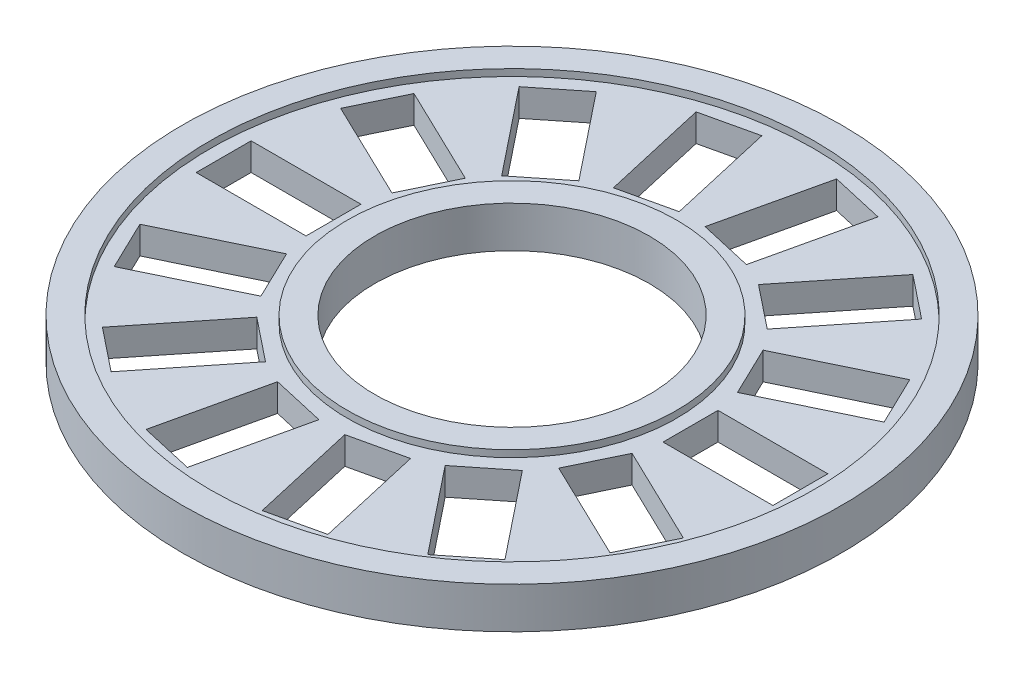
ISO-10303-21;
HEADER;
FILE_DESCRIPTION(('STEP AP214'),'2;1');
FILE_NAME('part.step','',(''),(''),'','','');
FILE_SCHEMA(('AUTOMOTIVE_DESIGN { 1 0 10303 214 1 1 1 1 }'));
ENDSEC;
DATA;
#1=APPLICATION_CONTEXT('core data for automotive mechanical design processes');
#2=APPLICATION_PROTOCOL_DEFINITION('international standard','automotive_design',2000,#1);
#3=PRODUCT_CONTEXT('',#1,'mechanical');
#4=PRODUCT('Part','Part','',(#3));
#5=PRODUCT_RELATED_PRODUCT_CATEGORY('part','',(#4));
#6=PRODUCT_DEFINITION_FORMATION('','',#4);
#7=PRODUCT_DEFINITION_CONTEXT('part definition',#1,'design');
#8=PRODUCT_DEFINITION('design','',#6,#7);
#9=PRODUCT_DEFINITION_SHAPE('','',#8);
#10=(LENGTH_UNIT() NAMED_UNIT(*) SI_UNIT(.MILLI.,.METRE.));
#11=(NAMED_UNIT(*) PLANE_ANGLE_UNIT() SI_UNIT($,.RADIAN.));
#12=(NAMED_UNIT(*) SI_UNIT($,.STERADIAN.) SOLID_ANGLE_UNIT());
#13=UNCERTAINTY_MEASURE_WITH_UNIT(LENGTH_MEASURE(1.E-05),#10,'distance_accuracy_value','');
#14=(GEOMETRIC_REPRESENTATION_CONTEXT(3) GLOBAL_UNCERTAINTY_ASSIGNED_CONTEXT((#13)) GLOBAL_UNIT_ASSIGNED_CONTEXT((#10,
#11,#12)) REPRESENTATION_CONTEXT('',''));
#15=CARTESIAN_POINT('',(0.,0.,0.));
#16=DIRECTION('',(0.,0.,1.));
#17=DIRECTION('',(1.,0.,0.));
#18=AXIS2_PLACEMENT_3D('',#15,#16,#17);
#19=CARTESIAN_POINT('',(5.99999999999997,0.,0.));
#20=DIRECTION('',(0.,-1.,0.));
#21=DIRECTION('',(0.,0.,-1.));
#22=AXIS2_PLACEMENT_3D('',#19,#20,#21);
#23=PLANE('',#22);
#24=CARTESIAN_POINT('',(0.,0.,0.));
#25=DIRECTION('',(0.,-1.,0.));
#26=DIRECTION('',(0.,0.,-1.));
#27=AXIS2_PLACEMENT_3D('',#24,#25,#26);
#28=CIRCLE('',#27,5.99999999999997);
#29=CARTESIAN_POINT('',(0.,0.,-5.99999999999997));
#30=VERTEX_POINT('',#29);
#31=EDGE_CURVE('E658',#30,#30,#28,.T.);
#32=ORIENTED_EDGE('',*,*,#31,.T.);
#33=EDGE_LOOP('',(#32));
#34=FACE_BOUND('',#33,.T.);
#35=CARTESIAN_POINT('',(0.,0.,0.));
#36=DIRECTION('',(0.,-1.,0.));
#37=DIRECTION('',(0.,0.,-1.));
#38=AXIS2_PLACEMENT_3D('',#35,#36,#37);
#39=CIRCLE('',#38,4.99999999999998);
#40=CARTESIAN_POINT('',(0.,0.,-4.99999999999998));
#41=VERTEX_POINT('',#40);
#42=EDGE_CURVE('E697',#41,#41,#39,.T.);
#43=ORIENTED_EDGE('',*,*,#42,.F.);
#44=EDGE_LOOP('',(#43));
#45=FACE_BOUND('',#44,.T.);
#46=ADVANCED_FACE('F27',(#34,#45),#23,.T.);
#47=CARTESIAN_POINT('',(0.,0.,0.));
#48=DIRECTION('',(0.,-1.,0.));
#49=DIRECTION('',(0.,0.,-1.));
#50=AXIS2_PLACEMENT_3D('',#47,#48,#49);
#51=CYLINDRICAL_SURFACE('',#50,4.99999999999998);
#52=ORIENTED_EDGE('',*,*,#42,.T.);
#53=EDGE_LOOP('',(#52));
#54=FACE_BOUND('',#53,.T.);
#55=CARTESIAN_POINT('',(0.,1.5,0.));
#56=DIRECTION('',(0.,-1.,0.));
#57=DIRECTION('',(0.,0.,-1.));
#58=AXIS2_PLACEMENT_3D('',#55,#56,#57);
#59=CIRCLE('',#58,4.99999999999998);
#60=CARTESIAN_POINT('',(0.,1.5,-4.99999999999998));
#61=VERTEX_POINT('',#60);
#62=EDGE_CURVE('E694',#61,#61,#59,.T.);
#63=ORIENTED_EDGE('',*,*,#62,.F.);
#64=EDGE_LOOP('',(#63));
#65=FACE_BOUND('',#64,.T.);
#66=ADVANCED_FACE('F838',(#54,#65),#51,.F.);
#67=CARTESIAN_POINT('',(4.99999999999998,1.5,0.));
#68=DIRECTION('',(0.,1.,0.));
#69=DIRECTION('',(0.,0.,1.));
#70=AXIS2_PLACEMENT_3D('',#67,#68,#69);
#71=PLANE('',#70);
#72=ORIENTED_EDGE('',*,*,#62,.T.);
#73=EDGE_LOOP('',(#72));
#74=FACE_BOUND('',#73,.T.);
#75=CARTESIAN_POINT('',(0.,1.5,0.));
#76=DIRECTION('',(0.,-1.,0.));
#77=DIRECTION('',(0.,0.,-1.));
#78=AXIS2_PLACEMENT_3D('',#75,#76,#77);
#79=CIRCLE('',#78,5.99999999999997);
#80=CARTESIAN_POINT('',(0.,1.5,-5.99999999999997));
#81=VERTEX_POINT('',#80);
#82=EDGE_CURVE('E691',#81,#81,#79,.T.);
#83=ORIENTED_EDGE('',*,*,#82,.F.);
#84=EDGE_LOOP('',(#83));
#85=FACE_BOUND('',#84,.T.);
#86=ADVANCED_FACE('F843',(#74,#85),#71,.T.);
#87=CARTESIAN_POINT('',(0.,0.,0.));
#88=DIRECTION('',(0.,-1.,0.));
#89=DIRECTION('',(0.,0.,-1.));
#90=AXIS2_PLACEMENT_3D('',#87,#88,#89);
#91=CYLINDRICAL_SURFACE('',#90,5.99999999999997);
#92=ORIENTED_EDGE('',*,*,#82,.T.);
#93=EDGE_LOOP('',(#92));
#94=FACE_BOUND('',#93,.T.);
#95=CARTESIAN_POINT('',(0.,1.25,0.));
#96=DIRECTION('',(0.,-1.,0.));
#97=DIRECTION('',(0.,0.,-1.));
#98=AXIS2_PLACEMENT_3D('',#95,#96,#97);
#99=CIRCLE('',#98,5.99999999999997);
#100=CARTESIAN_POINT('',(0.,1.25,-5.99999999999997));
#101=VERTEX_POINT('',#100);
#102=EDGE_CURVE('E688',#101,#101,#99,.T.);
#103=ORIENTED_EDGE('',*,*,#102,.F.);
#104=EDGE_LOOP('',(#103));
#105=FACE_BOUND('',#104,.T.);
#106=ADVANCED_FACE('F853',(#94,#105),#91,.T.);
#107=CARTESIAN_POINT('',(5.99999999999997,1.25,0.));
#108=DIRECTION('',(0.,1.,0.));
#109=DIRECTION('',(0.,0.,1.));
#110=AXIS2_PLACEMENT_3D('',#107,#108,#109);
#111=PLANE('',#110);
#112=DIRECTION('',(0.433883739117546,0.,-0.900968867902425));
#113=VECTOR('',#112,1.);
#114=CARTESIAN_POINT('',(-5.42241390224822,1.25,-3.72121317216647));
#115=LINE('',#114,#113);
#116=CARTESIAN_POINT('',(-6.2901813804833,1.25,-1.91927543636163));
#117=VERTEX_POINT('',#116);
#118=CARTESIAN_POINT('',(-5.42241390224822,1.25,-3.72121317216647));
#119=VERTEX_POINT('',#118);
#120=EDGE_CURVE('E41',#117,#119,#115,.T.);
#121=ORIENTED_EDGE('',*,*,#120,.F.);
#122=DIRECTION('',(0.900968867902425,0.,0.433883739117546));
#123=VECTOR('',#122,1.);
#124=CARTESIAN_POINT('',(-6.2901813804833,1.25,-1.91927543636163));
#125=LINE('',#124,#123);
#126=CARTESIAN_POINT('',(-9.894056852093,1.25,-3.65481039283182));
#127=VERTEX_POINT('',#126);
#128=EDGE_CURVE('E387',#127,#117,#125,.T.);
#129=ORIENTED_EDGE('',*,*,#128,.F.);
#130=DIRECTION('',(-0.433883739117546,0.,0.900968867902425));
#131=VECTOR('',#130,1.);
#132=CARTESIAN_POINT('',(-9.02628937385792,1.25,-5.45674812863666));
#133=LINE('',#132,#131);
#134=CARTESIAN_POINT('',(-9.02628937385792,1.25,-5.45674812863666));
#135=VERTEX_POINT('',#134);
#136=EDGE_CURVE('E394',#135,#127,#133,.T.);
#137=ORIENTED_EDGE('',*,*,#136,.F.);
#138=DIRECTION('',(-0.900968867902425,0.,-0.433883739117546));
#139=VECTOR('',#138,1.);
#140=CARTESIAN_POINT('',(-5.42241390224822,1.25,-3.72121317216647));
#141=LINE('',#140,#139);
#142=EDGE_CURVE('E399',#119,#135,#141,.T.);
#143=ORIENTED_EDGE('',*,*,#142,.F.);
#144=EDGE_LOOP('',(#121,#129,#137,#143));
#145=FACE_BOUND('',#144,.T.);
#146=DIRECTION('',(0.781831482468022,0.,-0.623489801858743));
#147=VECTOR('',#146,1.);
#148=CARTESIAN_POINT('',(-3.27085222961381,1.25,-5.70539443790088));
#149=LINE('',#148,#147);
#150=CARTESIAN_POINT('',(-4.83451519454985,1.25,-4.4584148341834));
#151=VERTEX_POINT('',#150);
#152=CARTESIAN_POINT('',(-3.27085222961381,1.25,-5.70539443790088));
#153=VERTEX_POINT('',#152);
#154=EDGE_CURVE('E410',#151,#153,#149,.T.);
#155=ORIENTED_EDGE('',*,*,#154,.F.);
#156=DIRECTION('',(0.623489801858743,0.,0.781831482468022));
#157=VECTOR('',#156,1.);
#158=CARTESIAN_POINT('',(-4.83451519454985,1.25,-4.4584148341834));
#159=LINE('',#158,#157);
#160=CARTESIAN_POINT('',(-7.32847440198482,1.25,-7.58574076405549));
#161=VERTEX_POINT('',#160);
#162=EDGE_CURVE('E414',#161,#151,#159,.T.);
#163=ORIENTED_EDGE('',*,*,#162,.F.);
#164=DIRECTION('',(-0.781831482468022,0.,0.623489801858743));
#165=VECTOR('',#164,1.);
#166=CARTESIAN_POINT('',(-5.76481143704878,1.25,-8.83272036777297));
#167=LINE('',#166,#165);
#168=CARTESIAN_POINT('',(-5.76481143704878,1.25,-8.83272036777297));
#169=VERTEX_POINT('',#168);
#170=EDGE_CURVE('E418',#169,#161,#167,.T.);
#171=ORIENTED_EDGE('',*,*,#170,.F.);
#172=DIRECTION('',(-0.623489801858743,0.,-0.781831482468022));
#173=VECTOR('',#172,1.);
#174=CARTESIAN_POINT('',(-3.27085222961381,1.25,-5.70539443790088));
#175=LINE('',#174,#173);
#176=EDGE_CURVE('E421',#153,#169,#175,.T.);
#177=ORIENTED_EDGE('',*,*,#176,.F.);
#178=EDGE_LOOP('',(#155,#163,#171,#177));
#179=FACE_BOUND('',#178,.T.);
#180=DIRECTION('',(0.974927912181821,0.,-0.222520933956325));
#181=VECTOR('',#180,1.);
#182=CARTESIAN_POINT('',(-0.471458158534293,1.25,-6.55955236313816));
#183=LINE('',#182,#181);
#184=CARTESIAN_POINT('',(-2.42131398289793,1.25,-6.11451049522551));
#185=VERTEX_POINT('',#184);
#186=CARTESIAN_POINT('',(-0.471458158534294,1.25,-6.55955236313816));
#187=VERTEX_POINT('',#186);
#188=EDGE_CURVE('E417',#185,#187,#183,.T.);
#189=ORIENTED_EDGE('',*,*,#188,.F.);
#190=DIRECTION('',(0.222520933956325,0.,0.974927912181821));
#191=VECTOR('',#190,1.);
#192=CARTESIAN_POINT('',(-2.42131398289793,1.25,-6.11451049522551));
#193=LINE('',#192,#191);
#194=CARTESIAN_POINT('',(-3.31139771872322,1.25,-10.0142221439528));
#195=VERTEX_POINT('',#194);
#196=EDGE_CURVE('E432',#195,#185,#193,.T.);
#197=ORIENTED_EDGE('',*,*,#196,.F.);
#198=DIRECTION('',(-0.974927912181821,0.,0.222520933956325));
#199=VECTOR('',#198,1.);
#200=CARTESIAN_POINT('',(-1.36154189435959,1.25,-10.4592640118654));
#201=LINE('',#200,#199);
#202=CARTESIAN_POINT('',(-1.36154189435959,1.25,-10.4592640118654));
#203=VERTEX_POINT('',#202);
#204=EDGE_CURVE('E429',#203,#195,#201,.T.);
#205=ORIENTED_EDGE('',*,*,#204,.F.);
#206=DIRECTION('',(-0.222520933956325,0.,-0.974927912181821));
#207=VECTOR('',#206,1.);
#208=CARTESIAN_POINT('',(-0.471458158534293,1.25,-6.55955236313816));
#209=LINE('',#208,#207);
#210=EDGE_CURVE('E426',#187,#203,#209,.T.);
#211=ORIENTED_EDGE('',*,*,#210,.F.);
#212=EDGE_LOOP('',(#189,#197,#205,#211));
#213=FACE_BOUND('',#212,.T.);
#214=DIRECTION('',(0.974927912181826,0.,0.222520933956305));
#215=VECTOR('',#214,1.);
#216=CARTESIAN_POINT('',(2.4213139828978,1.25,-6.11451049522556));
#217=LINE('',#216,#215);
#218=CARTESIAN_POINT('',(0.471458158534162,1.25,-6.55955236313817));
#219=VERTEX_POINT('',#218);
#220=CARTESIAN_POINT('',(2.4213139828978,1.25,-6.11451049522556));
#221=VERTEX_POINT('',#220);
#222=EDGE_CURVE('E450',#219,#221,#217,.T.);
#223=ORIENTED_EDGE('',*,*,#222,.F.);
#224=DIRECTION('',(-0.222520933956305,0.,0.974927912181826));
#225=VECTOR('',#224,1.);
#226=CARTESIAN_POINT('',(0.471458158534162,1.25,-6.55955236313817));
#227=LINE('',#226,#225);
#228=CARTESIAN_POINT('',(1.36154189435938,1.25,-10.4592640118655));
#229=VERTEX_POINT('',#228);
#230=EDGE_CURVE('E454',#229,#219,#227,.T.);
#231=ORIENTED_EDGE('',*,*,#230,.F.);
#232=DIRECTION('',(-0.974927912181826,0.,-0.222520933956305));
#233=VECTOR('',#232,1.);
#234=CARTESIAN_POINT('',(3.31139771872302,1.25,-10.0142221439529));
#235=LINE('',#234,#233);
#236=CARTESIAN_POINT('',(3.31139771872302,1.25,-10.0142221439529));
#237=VERTEX_POINT('',#236);
#238=EDGE_CURVE('E458',#237,#229,#235,.T.);
#239=ORIENTED_EDGE('',*,*,#238,.F.);
#240=DIRECTION('',(0.222520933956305,0.,-0.974927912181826));
#241=VECTOR('',#240,1.);
#242=CARTESIAN_POINT('',(2.4213139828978,1.25,-6.11451049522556));
#243=LINE('',#242,#241);
#244=EDGE_CURVE('E461',#221,#237,#243,.T.);
#245=ORIENTED_EDGE('',*,*,#244,.F.);
#246=EDGE_LOOP('',(#223,#231,#239,#245));
#247=FACE_BOUND('',#246,.T.);
#248=DIRECTION('',(0.781831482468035,0.,0.623489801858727));
#249=VECTOR('',#248,1.);
#250=CARTESIAN_POINT('',(4.83451519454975,1.25,-4.4584148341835));
#251=LINE('',#250,#249);
#252=CARTESIAN_POINT('',(3.27085222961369,1.25,-5.70539443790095));
#253=VERTEX_POINT('',#252);
#254=CARTESIAN_POINT('',(4.83451519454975,1.25,-4.45841483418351));
#255=VERTEX_POINT('',#254);
#256=EDGE_CURVE('E470',#253,#255,#251,.T.);
#257=ORIENTED_EDGE('',*,*,#256,.F.);
#258=DIRECTION('',(-0.623489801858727,0.,0.781831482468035));
#259=VECTOR('',#258,1.);
#260=CARTESIAN_POINT('',(3.27085222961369,1.25,-5.70539443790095));
#261=LINE('',#260,#259);
#262=CARTESIAN_POINT('',(5.7648114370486,1.25,-8.83272036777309));
#263=VERTEX_POINT('',#262);
#264=EDGE_CURVE('E474',#263,#253,#261,.T.);
#265=ORIENTED_EDGE('',*,*,#264,.F.);
#266=DIRECTION('',(-0.781831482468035,0.,-0.623489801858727));
#267=VECTOR('',#266,1.);
#268=CARTESIAN_POINT('',(7.32847440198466,1.25,-7.58574076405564));
#269=LINE('',#268,#267);
#270=CARTESIAN_POINT('',(7.32847440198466,1.25,-7.58574076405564));
#271=VERTEX_POINT('',#270);
#272=EDGE_CURVE('E478',#271,#263,#269,.T.);
#273=ORIENTED_EDGE('',*,*,#272,.F.);
#274=DIRECTION('',(0.623489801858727,0.,-0.781831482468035));
#275=VECTOR('',#274,1.);
#276=CARTESIAN_POINT('',(4.83451519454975,1.25,-4.4584148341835));
#277=LINE('',#276,#275);
#278=EDGE_CURVE('E481',#255,#271,#277,.T.);
#279=ORIENTED_EDGE('',*,*,#278,.F.);
#280=EDGE_LOOP('',(#257,#265,#273,#279));
#281=FACE_BOUND('',#280,.T.);
#282=DIRECTION('',(0.433883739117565,0.,0.900968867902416));
#283=VECTOR('',#282,1.);
#284=CARTESIAN_POINT('',(6.29018138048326,1.25,-1.91927543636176));
#285=LINE('',#284,#283);
#286=CARTESIAN_POINT('',(5.42241390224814,1.25,-3.72121317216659));
#287=VERTEX_POINT('',#286);
#288=CARTESIAN_POINT('',(6.29018138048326,1.25,-1.91927543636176));
#289=VERTEX_POINT('',#288);
#290=EDGE_CURVE('E477',#287,#289,#285,.T.);
#291=ORIENTED_EDGE('',*,*,#290,.F.);
#292=DIRECTION('',(-0.900968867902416,0.,0.433883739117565));
#293=VECTOR('',#292,1.);
#294=CARTESIAN_POINT('',(5.42241390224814,1.25,-3.72121317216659));
#295=LINE('',#294,#293);
#296=CARTESIAN_POINT('',(9.0262893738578,1.25,-5.45674812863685));
#297=VERTEX_POINT('',#296);
#298=EDGE_CURVE('E492',#297,#287,#295,.T.);
#299=ORIENTED_EDGE('',*,*,#298,.F.);
#300=DIRECTION('',(-0.433883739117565,0.,-0.900968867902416));
#301=VECTOR('',#300,1.);
#302=CARTESIAN_POINT('',(9.89405685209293,1.25,-3.65481039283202));
#303=LINE('',#302,#301);
#304=CARTESIAN_POINT('',(9.89405685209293,1.25,-3.65481039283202));
#305=VERTEX_POINT('',#304);
#306=EDGE_CURVE('E489',#305,#297,#303,.T.);
#307=ORIENTED_EDGE('',*,*,#306,.F.);
#308=DIRECTION('',(0.900968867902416,0.,-0.433883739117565));
#309=VECTOR('',#308,1.);
#310=CARTESIAN_POINT('',(6.29018138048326,1.25,-1.91927543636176));
#311=LINE('',#310,#309);
#312=EDGE_CURVE('E486',#289,#305,#311,.T.);
#313=ORIENTED_EDGE('',*,*,#312,.F.);
#314=EDGE_LOOP('',(#291,#299,#307,#313));
#315=FACE_BOUND('',#314,.T.);
#316=DIRECTION('',(0.,0.,1.));
#317=VECTOR('',#316,1.);
#318=CARTESIAN_POINT('',(6.50000000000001,1.25,0.99999999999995));
#319=LINE('',#318,#317);
#320=CARTESIAN_POINT('',(6.49999999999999,1.25,-1.00000000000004));
#321=VERTEX_POINT('',#320);
#322=CARTESIAN_POINT('',(6.50000000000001,1.25,0.99999999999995));
#323=VERTEX_POINT('',#322);
#324=EDGE_CURVE('E498',#321,#323,#319,.T.);
#325=ORIENTED_EDGE('',*,*,#324,.F.);
#326=DIRECTION('',(-1.,0.,0.));
#327=VECTOR('',#326,1.);
#328=CARTESIAN_POINT('',(6.49999999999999,1.25,-1.00000000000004));
#329=LINE('',#328,#327);
#330=CARTESIAN_POINT('',(10.5,1.25,-1.00000000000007));
#331=VERTEX_POINT('',#330);
#332=EDGE_CURVE('E512',#331,#321,#329,.T.);
#333=ORIENTED_EDGE('',*,*,#332,.F.);
#334=DIRECTION('',(0.,0.,-1.));
#335=VECTOR('',#334,1.);
#336=CARTESIAN_POINT('',(10.5,1.25,0.999999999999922));
#337=LINE('',#336,#335);
#338=CARTESIAN_POINT('',(10.5,1.25,0.999999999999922));
#339=VERTEX_POINT('',#338);
#340=EDGE_CURVE('E509',#339,#331,#337,.T.);
#341=ORIENTED_EDGE('',*,*,#340,.F.);
#342=DIRECTION('',(1.,0.,0.));
#343=VECTOR('',#342,1.);
#344=CARTESIAN_POINT('',(6.50000000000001,1.25,0.99999999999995));
#345=LINE('',#344,#343);
#346=EDGE_CURVE('E506',#323,#339,#345,.T.);
#347=ORIENTED_EDGE('',*,*,#346,.F.);
#348=EDGE_LOOP('',(#325,#333,#341,#347));
#349=FACE_BOUND('',#348,.T.);
#350=DIRECTION('',(-0.433883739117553,0.,0.900968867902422));
#351=VECTOR('',#350,1.);
#352=CARTESIAN_POINT('',(5.42241390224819,1.25,3.72121317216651));
#353=LINE('',#352,#351);
#354=CARTESIAN_POINT('',(6.29018138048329,1.25,1.91927543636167));
#355=VERTEX_POINT('',#354);
#356=CARTESIAN_POINT('',(5.42241390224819,1.25,3.72121317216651));
#357=VERTEX_POINT('',#356);
#358=EDGE_CURVE('E530',#355,#357,#353,.T.);
#359=ORIENTED_EDGE('',*,*,#358,.F.);
#360=DIRECTION('',(-0.900968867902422,0.,-0.433883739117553));
#361=VECTOR('',#360,1.);
#362=CARTESIAN_POINT('',(6.29018138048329,1.25,1.91927543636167));
#363=LINE('',#362,#361);
#364=CARTESIAN_POINT('',(9.89405685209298,1.25,3.65481039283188));
#365=VERTEX_POINT('',#364);
#366=EDGE_CURVE('E534',#365,#355,#363,.T.);
#367=ORIENTED_EDGE('',*,*,#366,.F.);
#368=DIRECTION('',(0.433883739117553,0.,-0.900968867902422));
#369=VECTOR('',#368,1.);
#370=CARTESIAN_POINT('',(9.02628937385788,1.25,5.45674812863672));
#371=LINE('',#370,#369);
#372=CARTESIAN_POINT('',(9.02628937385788,1.25,5.45674812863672));
#373=VERTEX_POINT('',#372);
#374=EDGE_CURVE('E538',#373,#365,#371,.T.);
#375=ORIENTED_EDGE('',*,*,#374,.F.);
#376=DIRECTION('',(0.900968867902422,0.,0.433883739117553));
#377=VECTOR('',#376,1.);
#378=CARTESIAN_POINT('',(5.42241390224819,1.25,3.72121317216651));
#379=LINE('',#378,#377);
#380=EDGE_CURVE('E541',#357,#373,#379,.T.);
#381=ORIENTED_EDGE('',*,*,#380,.F.);
#382=EDGE_LOOP('',(#359,#367,#375,#381));
#383=FACE_BOUND('',#382,.T.);
#384=DIRECTION('',(-0.781831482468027,0.,0.623489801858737));
#385=VECTOR('',#384,1.);
#386=CARTESIAN_POINT('',(3.27085222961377,1.25,5.70539443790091));
#387=LINE('',#386,#385);
#388=CARTESIAN_POINT('',(4.83451519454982,1.25,4.45841483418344));
#389=VERTEX_POINT('',#388);
#390=CARTESIAN_POINT('',(3.27085222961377,1.25,5.70539443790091));
#391=VERTEX_POINT('',#390);
#392=EDGE_CURVE('E550',#389,#391,#387,.T.);
#393=ORIENTED_EDGE('',*,*,#392,.F.);
#394=DIRECTION('',(-0.623489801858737,0.,-0.781831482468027));
#395=VECTOR('',#394,1.);
#396=CARTESIAN_POINT('',(4.83451519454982,1.25,4.45841483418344));
#397=LINE('',#396,#395);
#398=CARTESIAN_POINT('',(7.32847440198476,1.25,7.58574076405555));
#399=VERTEX_POINT('',#398);
#400=EDGE_CURVE('E554',#399,#389,#397,.T.);
#401=ORIENTED_EDGE('',*,*,#400,.F.);
#402=DIRECTION('',(0.781831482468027,0.,-0.623489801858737));
#403=VECTOR('',#402,1.);
#404=CARTESIAN_POINT('',(5.76481143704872,1.25,8.83272036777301));
#405=LINE('',#404,#403);
#406=CARTESIAN_POINT('',(5.76481143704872,1.25,8.83272036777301));
#407=VERTEX_POINT('',#406);
#408=EDGE_CURVE('E558',#407,#399,#405,.T.);
#409=ORIENTED_EDGE('',*,*,#408,.F.);
#410=DIRECTION('',(0.623489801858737,0.,0.781831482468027));
#411=VECTOR('',#410,1.);
#412=CARTESIAN_POINT('',(3.27085222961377,1.25,5.70539443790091));
#413=LINE('',#412,#411);
#414=EDGE_CURVE('E561',#391,#407,#413,.T.);
#415=ORIENTED_EDGE('',*,*,#414,.F.);
#416=EDGE_LOOP('',(#393,#401,#409,#415));
#417=FACE_BOUND('',#416,.T.);
#418=DIRECTION('',(-0.974927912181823,0.,0.222520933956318));
#419=VECTOR('',#418,1.);
#420=CARTESIAN_POINT('',(0.47145815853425,1.25,6.55955236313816));
#421=LINE('',#420,#419);
#422=CARTESIAN_POINT('',(2.42131398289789,1.25,6.11451049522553));
#423=VERTEX_POINT('',#422);
#424=CARTESIAN_POINT('',(0.47145815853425,1.25,6.55955236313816));
#425=VERTEX_POINT('',#424);
#426=EDGE_CURVE('E557',#423,#425,#421,.T.);
#427=ORIENTED_EDGE('',*,*,#426,.F.);
#428=DIRECTION('',(-0.222520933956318,0.,-0.974927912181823));
#429=VECTOR('',#428,1.);
#430=CARTESIAN_POINT('',(2.42131398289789,1.25,6.11451049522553));
#431=LINE('',#430,#429);
#432=CARTESIAN_POINT('',(3.31139771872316,1.25,10.0142221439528));
#433=VERTEX_POINT('',#432);
#434=EDGE_CURVE('E572',#433,#423,#431,.T.);
#435=ORIENTED_EDGE('',*,*,#434,.F.);
#436=DIRECTION('',(0.974927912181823,0.,-0.222520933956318));
#437=VECTOR('',#436,1.);
#438=CARTESIAN_POINT('',(1.36154189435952,1.25,10.4592640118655));
#439=LINE('',#438,#437);
#440=CARTESIAN_POINT('',(1.36154189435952,1.25,10.4592640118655));
#441=VERTEX_POINT('',#440);
#442=EDGE_CURVE('E569',#441,#433,#439,.T.);
#443=ORIENTED_EDGE('',*,*,#442,.F.);
#444=DIRECTION('',(0.222520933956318,0.,0.974927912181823));
#445=VECTOR('',#444,1.);
#446=CARTESIAN_POINT('',(0.47145815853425,1.25,6.55955236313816));
#447=LINE('',#446,#445);
#448=EDGE_CURVE('E566',#425,#441,#447,.T.);
#449=ORIENTED_EDGE('',*,*,#448,.F.);
#450=EDGE_LOOP('',(#427,#435,#443,#449));
#451=FACE_BOUND('',#450,.T.);
#452=DIRECTION('',(-0.974927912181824,0.,-0.222520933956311));
#453=VECTOR('',#452,1.);
#454=CARTESIAN_POINT('',(-2.42131398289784,1.25,6.11451049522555));
#455=LINE('',#454,#453);
#456=CARTESIAN_POINT('',(-0.471458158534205,1.25,6.55955236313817));
#457=VERTEX_POINT('',#456);
#458=CARTESIAN_POINT('',(-2.42131398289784,1.25,6.11451049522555));
#459=VERTEX_POINT('',#458);
#460=EDGE_CURVE('E590',#457,#459,#455,.T.);
#461=ORIENTED_EDGE('',*,*,#460,.F.);
#462=DIRECTION('',(0.222520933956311,0.,-0.974927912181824));
#463=VECTOR('',#462,1.);
#464=CARTESIAN_POINT('',(-0.471458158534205,1.25,6.55955236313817));
#465=LINE('',#464,#463);
#466=CARTESIAN_POINT('',(-1.36154189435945,1.25,10.4592640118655));
#467=VERTEX_POINT('',#466);
#468=EDGE_CURVE('E594',#467,#457,#465,.T.);
#469=ORIENTED_EDGE('',*,*,#468,.F.);
#470=DIRECTION('',(0.974927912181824,0.,0.222520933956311));
#471=VECTOR('',#470,1.);
#472=CARTESIAN_POINT('',(-3.31139771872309,1.25,10.0142221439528));
#473=LINE('',#472,#471);
#474=CARTESIAN_POINT('',(-3.31139771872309,1.25,10.0142221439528));
#475=VERTEX_POINT('',#474);
#476=EDGE_CURVE('E598',#475,#467,#473,.T.);
#477=ORIENTED_EDGE('',*,*,#476,.F.);
#478=DIRECTION('',(-0.222520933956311,0.,0.974927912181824));
#479=VECTOR('',#478,1.);
#480=CARTESIAN_POINT('',(-2.42131398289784,1.25,6.11451049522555));
#481=LINE('',#480,#479);
#482=EDGE_CURVE('E601',#459,#475,#481,.T.);
#483=ORIENTED_EDGE('',*,*,#482,.F.);
#484=EDGE_LOOP('',(#461,#469,#477,#483));
#485=FACE_BOUND('',#484,.T.);
#486=DIRECTION('',(-0.781831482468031,0.,-0.623489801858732));
#487=VECTOR('',#486,1.);
#488=CARTESIAN_POINT('',(-4.83451519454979,1.25,4.45841483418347));
#489=LINE('',#488,#487);
#490=CARTESIAN_POINT('',(-3.27085222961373,1.25,5.70539443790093));
#491=VERTEX_POINT('',#490);
#492=CARTESIAN_POINT('',(-4.83451519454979,1.25,4.45841483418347));
#493=VERTEX_POINT('',#492);
#494=EDGE_CURVE('E610',#491,#493,#489,.T.);
#495=ORIENTED_EDGE('',*,*,#494,.F.);
#496=DIRECTION('',(0.623489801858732,0.,-0.781831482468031));
#497=VECTOR('',#496,1.);
#498=CARTESIAN_POINT('',(-3.27085222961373,1.25,5.70539443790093));
#499=LINE('',#498,#497);
#500=CARTESIAN_POINT('',(-5.76481143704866,1.25,8.83272036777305));
#501=VERTEX_POINT('',#500);
#502=EDGE_CURVE('E614',#501,#491,#499,.T.);
#503=ORIENTED_EDGE('',*,*,#502,.F.);
#504=DIRECTION('',(0.781831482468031,0.,0.623489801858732));
#505=VECTOR('',#504,1.);
#506=CARTESIAN_POINT('',(-7.32847440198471,1.25,7.5857407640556));
#507=LINE('',#506,#505);
#508=CARTESIAN_POINT('',(-7.32847440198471,1.25,7.5857407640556));
#509=VERTEX_POINT('',#508);
#510=EDGE_CURVE('E618',#509,#501,#507,.T.);
#511=ORIENTED_EDGE('',*,*,#510,.F.);
#512=DIRECTION('',(-0.623489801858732,0.,0.781831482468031));
#513=VECTOR('',#512,1.);
#514=CARTESIAN_POINT('',(-4.83451519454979,1.25,4.45841483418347));
#515=LINE('',#514,#513);
#516=EDGE_CURVE('E621',#493,#509,#515,.T.);
#517=ORIENTED_EDGE('',*,*,#516,.F.);
#518=EDGE_LOOP('',(#495,#503,#511,#517));
#519=FACE_BOUND('',#518,.T.);
#520=DIRECTION('',(-0.433883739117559,0.,-0.900968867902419));
#521=VECTOR('',#520,1.);
#522=CARTESIAN_POINT('',(-6.29018138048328,1.25,1.91927543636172));
#523=LINE('',#522,#521);
#524=CARTESIAN_POINT('',(-5.42241390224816,1.25,3.72121317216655));
#525=VERTEX_POINT('',#524);
#526=CARTESIAN_POINT('',(-6.29018138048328,1.25,1.91927543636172));
#527=VERTEX_POINT('',#526);
#528=EDGE_CURVE('E617',#525,#527,#523,.T.);
#529=ORIENTED_EDGE('',*,*,#528,.F.);
#530=DIRECTION('',(0.900968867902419,0.,-0.433883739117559));
#531=VECTOR('',#530,1.);
#532=CARTESIAN_POINT('',(-5.42241390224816,1.25,3.72121317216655));
#533=LINE('',#532,#531);
#534=CARTESIAN_POINT('',(-9.02628937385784,1.25,5.45674812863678));
#535=VERTEX_POINT('',#534);
#536=EDGE_CURVE('E632',#535,#525,#533,.T.);
#537=ORIENTED_EDGE('',*,*,#536,.F.);
#538=DIRECTION('',(0.433883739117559,0.,0.900968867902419));
#539=VECTOR('',#538,1.);
#540=CARTESIAN_POINT('',(-9.89405685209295,1.25,3.65481039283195));
#541=LINE('',#540,#539);
#542=CARTESIAN_POINT('',(-9.89405685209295,1.25,3.65481039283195));
#543=VERTEX_POINT('',#542);
#544=EDGE_CURVE('E629',#543,#535,#541,.T.);
#545=ORIENTED_EDGE('',*,*,#544,.F.);
#546=DIRECTION('',(-0.900968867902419,0.,0.433883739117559));
#547=VECTOR('',#546,1.);
#548=CARTESIAN_POINT('',(-6.29018138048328,1.25,1.91927543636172));
#549=LINE('',#548,#547);
#550=EDGE_CURVE('E626',#527,#543,#549,.T.);
#551=ORIENTED_EDGE('',*,*,#550,.F.);
#552=EDGE_LOOP('',(#529,#537,#545,#551));
#553=FACE_BOUND('',#552,.T.);
#554=DIRECTION('',(0.,0.,-1.));
#555=VECTOR('',#554,1.);
#556=CARTESIAN_POINT('',(-6.5,1.25,-0.999999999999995));
#557=LINE('',#556,#555);
#558=CARTESIAN_POINT('',(-6.5,1.25,0.999999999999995));
#559=VERTEX_POINT('',#558);
#560=CARTESIAN_POINT('',(-6.5,1.25,-0.999999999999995));
#561=VERTEX_POINT('',#560);
#562=EDGE_CURVE('E638',#559,#561,#557,.T.);
#563=ORIENTED_EDGE('',*,*,#562,.F.);
#564=DIRECTION('',(1.,0.,0.));
#565=VECTOR('',#564,1.);
#566=CARTESIAN_POINT('',(-6.5,1.25,0.999999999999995));
#567=LINE('',#566,#565);
#568=CARTESIAN_POINT('',(-10.5,1.25,0.999999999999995));
#569=VERTEX_POINT('',#568);
#570=EDGE_CURVE('E652',#569,#559,#567,.T.);
#571=ORIENTED_EDGE('',*,*,#570,.F.);
#572=DIRECTION('',(0.,0.,1.));
#573=VECTOR('',#572,1.);
#574=CARTESIAN_POINT('',(-10.5,1.25,-0.999999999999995));
#575=LINE('',#574,#573);
#576=CARTESIAN_POINT('',(-10.5,1.25,-0.999999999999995));
#577=VERTEX_POINT('',#576);
#578=EDGE_CURVE('E649',#577,#569,#575,.T.);
#579=ORIENTED_EDGE('',*,*,#578,.F.);
#580=DIRECTION('',(-1.,0.,0.));
#581=VECTOR('',#580,1.);
#582=CARTESIAN_POINT('',(-6.5,1.25,-0.999999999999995));
#583=LINE('',#582,#581);
#584=EDGE_CURVE('E646',#561,#577,#583,.T.);
#585=ORIENTED_EDGE('',*,*,#584,.F.);
#586=EDGE_LOOP('',(#563,#571,#579,#585));
#587=FACE_BOUND('',#586,.T.);
#588=ORIENTED_EDGE('',*,*,#102,.T.);
#589=EDGE_LOOP('',(#588));
#590=FACE_BOUND('',#589,.T.);
#591=CARTESIAN_POINT('',(0.,1.25,0.));
#592=DIRECTION('',(0.,-1.,0.));
#593=DIRECTION('',(0.,0.,-1.));
#594=AXIS2_PLACEMENT_3D('',#591,#592,#593);
#595=CIRCLE('',#594,11.);
#596=CARTESIAN_POINT('',(0.,1.25,-11.));
#597=VERTEX_POINT('',#596);
#598=EDGE_CURVE('E685',#597,#597,#595,.T.);
#599=ORIENTED_EDGE('',*,*,#598,.F.);
#600=EDGE_LOOP('',(#599));
#601=FACE_BOUND('',#600,.T.);
#602=ADVANCED_FACE('F397',(#145,#179,#213,#247,#281,#315,#349,#383,#417,#451,#485,#519,#553,
#587,#590,#601),#111,.T.);
#603=CARTESIAN_POINT('',(0.,0.,0.));
#604=DIRECTION('',(0.,-1.,0.));
#605=DIRECTION('',(0.,0.,-1.));
#606=AXIS2_PLACEMENT_3D('',#603,#604,#605);
#607=CYLINDRICAL_SURFACE('',#606,11.);
#608=ORIENTED_EDGE('',*,*,#598,.T.);
#609=EDGE_LOOP('',(#608));
#610=FACE_BOUND('',#609,.T.);
#611=CARTESIAN_POINT('',(0.,1.5,0.));
#612=DIRECTION('',(0.,-1.,0.));
#613=DIRECTION('',(0.,0.,-1.));
#614=AXIS2_PLACEMENT_3D('',#611,#612,#613);
#615=CIRCLE('',#614,11.);
#616=CARTESIAN_POINT('',(0.,1.5,-11.));
#617=VERTEX_POINT('',#616);
#618=EDGE_CURVE('E682',#617,#617,#615,.T.);
#619=ORIENTED_EDGE('',*,*,#618,.F.);
#620=EDGE_LOOP('',(#619));
#621=FACE_BOUND('',#620,.T.);
#622=ADVANCED_FACE('F864',(#610,#621),#607,.F.);
#623=CARTESIAN_POINT('',(11.,1.5,0.));
#624=DIRECTION('',(0.,1.,0.));
#625=DIRECTION('',(0.,0.,1.));
#626=AXIS2_PLACEMENT_3D('',#623,#624,#625);
#627=PLANE('',#626);
#628=ORIENTED_EDGE('',*,*,#618,.T.);
#629=EDGE_LOOP('',(#628));
#630=FACE_BOUND('',#629,.T.);
#631=CARTESIAN_POINT('',(0.,1.5,0.));
#632=DIRECTION('',(0.,-1.,0.));
#633=DIRECTION('',(0.,0.,-1.));
#634=AXIS2_PLACEMENT_3D('',#631,#632,#633);
#635=CIRCLE('',#634,12.);
#636=CARTESIAN_POINT('',(0.,1.5,-12.));
#637=VERTEX_POINT('',#636);
#638=EDGE_CURVE('E679',#637,#637,#635,.T.);
#639=ORIENTED_EDGE('',*,*,#638,.F.);
#640=EDGE_LOOP('',(#639));
#641=FACE_BOUND('',#640,.T.);
#642=ADVANCED_FACE('F870',(#630,#641),#627,.T.);
#643=CARTESIAN_POINT('',(0.,0.,0.));
#644=DIRECTION('',(0.,-1.,0.));
#645=DIRECTION('',(0.,0.,-1.));
#646=AXIS2_PLACEMENT_3D('',#643,#644,#645);
#647=CYLINDRICAL_SURFACE('',#646,12.);
#648=ORIENTED_EDGE('',*,*,#638,.T.);
#649=EDGE_LOOP('',(#648));
#650=FACE_BOUND('',#649,.T.);
#651=CARTESIAN_POINT('',(0.,0.,0.));
#652=DIRECTION('',(0.,-1.,0.));
#653=DIRECTION('',(0.,0.,-1.));
#654=AXIS2_PLACEMENT_3D('',#651,#652,#653);
#655=CIRCLE('',#654,12.);
#656=CARTESIAN_POINT('',(0.,0.,-12.));
#657=VERTEX_POINT('',#656);
#658=EDGE_CURVE('E676',#657,#657,#655,.T.);
#659=ORIENTED_EDGE('',*,*,#658,.F.);
#660=EDGE_LOOP('',(#659));
#661=FACE_BOUND('',#660,.T.);
#662=ADVANCED_FACE('F876',(#650,#661),#647,.T.);
#663=CARTESIAN_POINT('',(12.,0.,0.));
#664=DIRECTION('',(0.,-1.,0.));
#665=DIRECTION('',(0.,0.,-1.));
#666=AXIS2_PLACEMENT_3D('',#663,#664,#665);
#667=PLANE('',#666);
#668=ORIENTED_EDGE('',*,*,#658,.T.);
#669=EDGE_LOOP('',(#668));
#670=FACE_BOUND('',#669,.T.);
#671=CARTESIAN_POINT('',(0.,0.,0.));
#672=DIRECTION('',(0.,-1.,0.));
#673=DIRECTION('',(0.,0.,-1.));
#674=AXIS2_PLACEMENT_3D('',#671,#672,#673);
#675=CIRCLE('',#674,11.);
#676=CARTESIAN_POINT('',(0.,0.,-11.));
#677=VERTEX_POINT('',#676);
#678=EDGE_CURVE('E673',#677,#677,#675,.T.);
#679=ORIENTED_EDGE('',*,*,#678,.F.);
#680=EDGE_LOOP('',(#679));
#681=FACE_BOUND('',#680,.T.);
#682=ADVANCED_FACE('F882',(#670,#681),#667,.T.);
#683=CARTESIAN_POINT('',(0.,0.,0.));
#684=DIRECTION('',(0.,-1.,0.));
#685=DIRECTION('',(0.,0.,-1.));
#686=AXIS2_PLACEMENT_3D('',#683,#684,#685);
#687=CYLINDRICAL_SURFACE('',#686,11.);
#688=ORIENTED_EDGE('',*,*,#678,.T.);
#689=EDGE_LOOP('',(#688));
#690=FACE_BOUND('',#689,.T.);
#691=CARTESIAN_POINT('',(0.,0.250000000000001,0.));
#692=DIRECTION('',(0.,-1.,0.));
#693=DIRECTION('',(0.,0.,-1.));
#694=AXIS2_PLACEMENT_3D('',#691,#692,#693);
#695=CIRCLE('',#694,11.);
#696=CARTESIAN_POINT('',(0.,0.250000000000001,-11.));
#697=VERTEX_POINT('',#696);
#698=EDGE_CURVE('E670',#697,#697,#695,.T.);
#699=ORIENTED_EDGE('',*,*,#698,.F.);
#700=EDGE_LOOP('',(#699));
#701=FACE_BOUND('',#700,.T.);
#702=ADVANCED_FACE('F888',(#690,#701),#687,.F.);
#703=CARTESIAN_POINT('',(11.,0.250000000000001,0.));
#704=DIRECTION('',(0.,-1.,0.));
#705=DIRECTION('',(0.,0.,-1.));
#706=AXIS2_PLACEMENT_3D('',#703,#704,#705);
#707=PLANE('',#706);
#708=DIRECTION('',(-0.433883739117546,0.,0.900968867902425));
#709=VECTOR('',#708,1.);
#710=CARTESIAN_POINT('',(-3.78549155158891,0.250000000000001,-7.12031745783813));
#711=LINE('',#710,#709);
#712=CARTESIAN_POINT('',(-5.42241390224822,0.250000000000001,-3.72121317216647));
#713=VERTEX_POINT('',#712);
#714=CARTESIAN_POINT('',(-6.2901813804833,0.250000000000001,-1.91927543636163));
#715=VERTEX_POINT('',#714);
#716=EDGE_CURVE('E11',#713,#715,#711,.T.);
#717=ORIENTED_EDGE('',*,*,#716,.F.);
#718=DIRECTION('',(0.900968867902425,0.,0.433883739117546));
#719=VECTOR('',#718,1.);
#720=CARTESIAN_POINT('',(9.36307764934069,0.250000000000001,3.39910428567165));
#721=LINE('',#720,#719);
#722=CARTESIAN_POINT('',(-9.02628937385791,0.250000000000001,-5.45674812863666));
#723=VERTEX_POINT('',#722);
#724=EDGE_CURVE('E817',#723,#713,#721,.T.);
#725=ORIENTED_EDGE('',*,*,#724,.F.);
#726=DIRECTION('',(0.433883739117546,0.,-0.900968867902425));
#727=VECTOR('',#726,1.);
#728=CARTESIAN_POINT('',(-7.3893670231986,0.250000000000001,-8.85585241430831));
#729=LINE('',#728,#727);
#730=CARTESIAN_POINT('',(-9.894056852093,0.250000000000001,-3.65481039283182));
#731=VERTEX_POINT('',#730);
#732=EDGE_CURVE('E819',#731,#723,#729,.T.);
#733=ORIENTED_EDGE('',*,*,#732,.F.);
#734=DIRECTION('',(-0.900968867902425,0.,-0.433883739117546));
#735=VECTOR('',#734,1.);
#736=CARTESIAN_POINT('',(8.4953101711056,0.250000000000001,5.2010420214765));
#737=LINE('',#736,#735);
#738=EDGE_CURVE('E34',#715,#731,#737,.T.);
#739=ORIENTED_EDGE('',*,*,#738,.F.);
#740=EDGE_LOOP('',(#717,#725,#733,#739));
#741=FACE_BOUND('',#740,.T.);
#742=DIRECTION('',(-0.781831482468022,0.,0.623489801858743));
#743=VECTOR('',#742,1.);
#744=CARTESIAN_POINT('',(2.67118142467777,0.250000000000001,-10.4440081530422));
#745=LINE('',#744,#743);
#746=CARTESIAN_POINT('',(-3.27085222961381,0.250000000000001,-5.70539443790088));
#747=VERTEX_POINT('',#746);
#748=CARTESIAN_POINT('',(-4.83451519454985,0.250000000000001,-4.4584148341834));
#749=VERTEX_POINT('',#748);
#750=EDGE_CURVE('E815',#747,#749,#745,.T.);
#751=ORIENTED_EDGE('',*,*,#750,.F.);
#752=DIRECTION('',(0.623489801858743,0.,0.781831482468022));
#753=VECTOR('',#752,1.);
#754=CARTESIAN_POINT('',(5.05796634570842,0.250000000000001,4.73861371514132));
#755=LINE('',#754,#753);
#756=CARTESIAN_POINT('',(-5.76481143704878,0.250000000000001,-8.83272036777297));
#757=VERTEX_POINT('',#756);
#758=EDGE_CURVE('E808',#757,#747,#755,.T.);
#759=ORIENTED_EDGE('',*,*,#758,.F.);
#760=DIRECTION('',(0.781831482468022,0.,-0.623489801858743));
#761=VECTOR('',#760,1.);
#762=CARTESIAN_POINT('',(0.177222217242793,0.250000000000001,-13.5713340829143));
#763=LINE('',#762,#761);
#764=CARTESIAN_POINT('',(-7.32847440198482,0.250000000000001,-7.58574076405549));
#765=VERTEX_POINT('',#764);
#766=EDGE_CURVE('E810',#765,#757,#763,.T.);
#767=ORIENTED_EDGE('',*,*,#766,.F.);
#768=DIRECTION('',(-0.623489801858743,0.,-0.781831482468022));
#769=VECTOR('',#768,1.);
#770=CARTESIAN_POINT('',(3.49430338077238,0.250000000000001,5.9855933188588));
#771=LINE('',#770,#769);
#772=EDGE_CURVE('E813',#749,#765,#771,.T.);
#773=ORIENTED_EDGE('',*,*,#772,.F.);
#774=EDGE_LOOP('',(#751,#759,#767,#773));
#775=FACE_BOUND('',#774,.T.);
#776=DIRECTION('',(-0.974927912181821,0.,0.222520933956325));
#777=VECTOR('',#776,1.);
#778=CARTESIAN_POINT('',(9.00894270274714,0.250000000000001,-8.72339199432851));
#779=LINE('',#778,#777);
#780=CARTESIAN_POINT('',(-0.471458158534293,0.250000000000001,-6.55955236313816));
#781=VERTEX_POINT('',#780);
#782=CARTESIAN_POINT('',(-2.42131398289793,0.250000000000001,-6.11451049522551));
#783=VERTEX_POINT('',#782);
#784=EDGE_CURVE('E806',#781,#783,#779,.T.);
#785=ORIENTED_EDGE('',*,*,#784,.F.);
#786=DIRECTION('',(0.222520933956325,0.,0.974927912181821));
#787=VECTOR('',#786,1.);
#788=CARTESIAN_POINT('',(1.51959913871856,0.250000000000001,2.16383963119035));
#789=LINE('',#788,#787);
#790=CARTESIAN_POINT('',(-1.36154189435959,0.250000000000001,-10.4592640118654));
#791=VERTEX_POINT('',#790);
#792=EDGE_CURVE('E799',#791,#781,#789,.T.);
#793=ORIENTED_EDGE('',*,*,#792,.F.);
#794=DIRECTION('',(0.974927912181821,0.,-0.222520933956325));
#795=VECTOR('',#794,1.);
#796=CARTESIAN_POINT('',(8.11885896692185,0.250000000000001,-12.6231036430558));
#797=LINE('',#796,#795);
#798=CARTESIAN_POINT('',(-3.31139771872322,0.250000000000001,-10.0142221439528));
#799=VERTEX_POINT('',#798);
#800=EDGE_CURVE('E801',#799,#791,#797,.T.);
#801=ORIENTED_EDGE('',*,*,#800,.F.);
#802=DIRECTION('',(-0.222520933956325,0.,-0.974927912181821));
#803=VECTOR('',#802,1.);
#804=CARTESIAN_POINT('',(-0.430256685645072,0.250000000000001,2.608881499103));
#805=LINE('',#804,#803);
#806=EDGE_CURVE('E804',#783,#799,#805,.T.);
#807=ORIENTED_EDGE('',*,*,#806,.F.);
#808=EDGE_LOOP('',(#785,#793,#801,#807));
#809=FACE_BOUND('',#808,.T.);
#810=DIRECTION('',(-0.974927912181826,0.,-0.222520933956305));
#811=VECTOR('',#810,1.);
#812=CARTESIAN_POINT('',(11.9017148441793,0.250000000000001,-3.95067086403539));
#813=LINE('',#812,#811);
#814=CARTESIAN_POINT('',(2.4213139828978,0.250000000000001,-6.11451049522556));
#815=VERTEX_POINT('',#814);
#816=CARTESIAN_POINT('',(0.471458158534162,0.250000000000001,-6.55955236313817));
#817=VERTEX_POINT('',#816);
#818=EDGE_CURVE('E797',#815,#817,#813,.T.);
#819=ORIENTED_EDGE('',*,*,#818,.F.);
#820=DIRECTION('',(-0.222520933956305,0.,0.974927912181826));
#821=VECTOR('',#820,1.);
#822=CARTESIAN_POINT('',(1.51959913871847,0.250000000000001,-2.16383963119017));
#823=LINE('',#822,#821);
#824=CARTESIAN_POINT('',(3.31139771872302,0.250000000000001,-10.0142221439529));
#825=VERTEX_POINT('',#824);
#826=EDGE_CURVE('E790',#825,#815,#823,.T.);
#827=ORIENTED_EDGE('',*,*,#826,.F.);
#828=DIRECTION('',(0.974927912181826,0.,0.222520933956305));
#829=VECTOR('',#828,1.);
#830=CARTESIAN_POINT('',(12.7917985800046,0.250000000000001,-7.85038251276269));
#831=LINE('',#830,#829);
#832=CARTESIAN_POINT('',(1.36154189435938,0.250000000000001,-10.4592640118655));
#833=VERTEX_POINT('',#832);
#834=EDGE_CURVE('E792',#833,#825,#831,.T.);
#835=ORIENTED_EDGE('',*,*,#834,.F.);
#836=DIRECTION('',(0.222520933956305,0.,-0.974927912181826));
#837=VECTOR('',#836,1.);
#838=CARTESIAN_POINT('',(-0.430256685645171,0.250000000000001,-2.60888149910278));
#839=LINE('',#838,#837);
#840=EDGE_CURVE('E795',#817,#833,#839,.T.);
#841=ORIENTED_EDGE('',*,*,#840,.F.);
#842=EDGE_LOOP('',(#819,#827,#835,#841));
#843=FACE_BOUND('',#842,.T.);
#844=DIRECTION('',(-0.781831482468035,0.,-0.623489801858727));
#845=VECTOR('',#844,1.);
#846=CARTESIAN_POINT('',(10.7765488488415,0.250000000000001,0.280198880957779));
#847=LINE('',#846,#845);
#848=CARTESIAN_POINT('',(4.83451519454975,0.250000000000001,-4.4584148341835));
#849=VERTEX_POINT('',#848);
#850=CARTESIAN_POINT('',(3.27085222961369,0.250000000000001,-5.70539443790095));
#851=VERTEX_POINT('',#850);
#852=EDGE_CURVE('E788',#849,#851,#847,.T.);
#853=ORIENTED_EDGE('',*,*,#852,.F.);
#854=DIRECTION('',(-0.623489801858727,0.,0.781831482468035));
#855=VECTOR('',#854,1.);
#856=CARTESIAN_POINT('',(5.05796634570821,0.250000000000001,-4.73861371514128));
#857=LINE('',#856,#855);
#858=CARTESIAN_POINT('',(7.32847440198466,0.250000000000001,-7.58574076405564));
#859=VERTEX_POINT('',#858);
#860=EDGE_CURVE('E781',#859,#849,#857,.T.);
#861=ORIENTED_EDGE('',*,*,#860,.F.);
#862=DIRECTION('',(0.781831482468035,0.,0.623489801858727));
#863=VECTOR('',#862,1.);
#864=CARTESIAN_POINT('',(13.2705080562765,0.250000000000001,-2.84712704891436));
#865=LINE('',#864,#863);
#866=CARTESIAN_POINT('',(5.7648114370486,0.250000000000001,-8.83272036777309));
#867=VERTEX_POINT('',#866);
#868=EDGE_CURVE('E783',#867,#859,#865,.T.);
#869=ORIENTED_EDGE('',*,*,#868,.F.);
#870=DIRECTION('',(0.623489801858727,0.,-0.781831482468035));
#871=VECTOR('',#870,1.);
#872=CARTESIAN_POINT('',(3.49430338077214,0.250000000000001,-5.98559331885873));
#873=LINE('',#872,#871);
#874=EDGE_CURVE('E786',#851,#867,#873,.T.);
#875=ORIENTED_EDGE('',*,*,#874,.F.);
#876=EDGE_LOOP('',(#853,#861,#869,#875));
#877=FACE_BOUND('',#876,.T.);
#878=DIRECTION('',(-0.433883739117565,0.,-0.900968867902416));
#879=VECTOR('',#878,1.);
#880=CARTESIAN_POINT('',(7.92710373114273,0.250000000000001,1.47982884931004));
#881=LINE('',#880,#879);
#882=CARTESIAN_POINT('',(6.29018138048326,0.250000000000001,-1.91927543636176));
#883=VERTEX_POINT('',#882);
#884=CARTESIAN_POINT('',(5.42241390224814,0.250000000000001,-3.72121317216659));
#885=VERTEX_POINT('',#884);
#886=EDGE_CURVE('E779',#883,#885,#881,.T.);
#887=ORIENTED_EDGE('',*,*,#886,.F.);
#888=DIRECTION('',(-0.900968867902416,0.,0.433883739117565));
#889=VECTOR('',#888,1.);
#890=CARTESIAN_POINT('',(9.36307764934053,0.250000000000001,-3.39910428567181));
#891=LINE('',#890,#889);
#892=CARTESIAN_POINT('',(9.89405685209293,0.250000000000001,-3.65481039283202));
#893=VERTEX_POINT('',#892);
#894=EDGE_CURVE('E772',#893,#883,#891,.T.);
#895=ORIENTED_EDGE('',*,*,#894,.F.);
#896=DIRECTION('',(0.433883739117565,0.,0.900968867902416));
#897=VECTOR('',#896,1.);
#898=CARTESIAN_POINT('',(11.5309792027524,0.250000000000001,-0.255706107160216));
#899=LINE('',#898,#897);
#900=CARTESIAN_POINT('',(9.0262893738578,0.250000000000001,-5.45674812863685));
#901=VERTEX_POINT('',#900);
#902=EDGE_CURVE('E774',#901,#893,#899,.T.);
#903=ORIENTED_EDGE('',*,*,#902,.F.);
#904=DIRECTION('',(0.900968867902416,0.,-0.433883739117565));
#905=VECTOR('',#904,1.);
#906=CARTESIAN_POINT('',(8.4953101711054,0.250000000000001,-5.20104202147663));
#907=LINE('',#906,#905);
#908=EDGE_CURVE('E777',#885,#901,#907,.T.);
#909=ORIENTED_EDGE('',*,*,#908,.F.);
#910=EDGE_LOOP('',(#887,#895,#903,#909));
#911=FACE_BOUND('',#910,.T.);
#912=DIRECTION('',(0.,0.,-1.));
#913=VECTOR('',#912,1.);
#914=CARTESIAN_POINT('',(6.5,0.250000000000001,0.));
#915=LINE('',#914,#913);
#916=CARTESIAN_POINT('',(6.50000000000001,0.250000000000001,0.99999999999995));
#917=VERTEX_POINT('',#916);
#918=CARTESIAN_POINT('',(6.49999999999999,0.250000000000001,-1.00000000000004));
#919=VERTEX_POINT('',#918);
#920=EDGE_CURVE('E770',#917,#919,#915,.T.);
#921=ORIENTED_EDGE('',*,*,#920,.F.);
#922=DIRECTION('',(-1.,0.,0.));
#923=VECTOR('',#922,1.);
#924=CARTESIAN_POINT('',(11.,0.250000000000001,0.999999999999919));
#925=LINE('',#924,#923);
#926=CARTESIAN_POINT('',(10.5,0.250000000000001,0.999999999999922));
#927=VERTEX_POINT('',#926);
#928=EDGE_CURVE('E763',#927,#917,#925,.T.);
#929=ORIENTED_EDGE('',*,*,#928,.F.);
#930=DIRECTION('',(0.,0.,1.));
#931=VECTOR('',#930,1.);
#932=CARTESIAN_POINT('',(10.5,0.250000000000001,0.));
#933=LINE('',#932,#931);
#934=CARTESIAN_POINT('',(10.5,0.250000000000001,-1.00000000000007));
#935=VERTEX_POINT('',#934);
#936=EDGE_CURVE('E765',#935,#927,#933,.T.);
#937=ORIENTED_EDGE('',*,*,#936,.F.);
#938=DIRECTION('',(1.,0.,0.));
#939=VECTOR('',#938,1.);
#940=CARTESIAN_POINT('',(11.,0.250000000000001,-1.00000000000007));
#941=LINE('',#940,#939);
#942=EDGE_CURVE('E768',#919,#935,#941,.T.);
#943=ORIENTED_EDGE('',*,*,#942,.F.);
#944=EDGE_LOOP('',(#921,#929,#937,#943));
#945=FACE_BOUND('',#944,.T.);
#946=DIRECTION('',(0.433883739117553,0.,-0.900968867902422));
#947=VECTOR('',#946,1.);
#948=CARTESIAN_POINT('',(7.92710373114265,0.250000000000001,-1.47982884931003));
#949=LINE('',#948,#947);
#950=CARTESIAN_POINT('',(5.42241390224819,0.250000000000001,3.72121317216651));
#951=VERTEX_POINT('',#950);
#952=CARTESIAN_POINT('',(6.29018138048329,0.250000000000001,1.91927543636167));
#953=VERTEX_POINT('',#952);
#954=EDGE_CURVE('E761',#951,#953,#949,.T.);
#955=ORIENTED_EDGE('',*,*,#954,.F.);
#956=DIRECTION('',(-0.900968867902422,0.,-0.433883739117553));
#957=VECTOR('',#956,1.);
#958=CARTESIAN_POINT('',(8.49531017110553,0.250000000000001,5.20104202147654));
#959=LINE('',#958,#957);
#960=CARTESIAN_POINT('',(9.02628937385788,0.250000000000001,5.45674812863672));
#961=VERTEX_POINT('',#960);
#962=EDGE_CURVE('E754',#961,#951,#959,.T.);
#963=ORIENTED_EDGE('',*,*,#962,.F.);
#964=DIRECTION('',(-0.433883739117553,0.,0.900968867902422));
#965=VECTOR('',#964,1.);
#966=CARTESIAN_POINT('',(11.5309792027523,0.250000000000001,0.25570610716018));
#967=LINE('',#966,#965);
#968=CARTESIAN_POINT('',(9.89405685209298,0.250000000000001,3.65481039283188));
#969=VERTEX_POINT('',#968);
#970=EDGE_CURVE('E756',#969,#961,#967,.T.);
#971=ORIENTED_EDGE('',*,*,#970,.F.);
#972=DIRECTION('',(0.900968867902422,0.,0.433883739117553));
#973=VECTOR('',#972,1.);
#974=CARTESIAN_POINT('',(9.36307764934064,0.250000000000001,3.3991042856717));
#975=LINE('',#974,#973);
#976=EDGE_CURVE('E759',#953,#969,#975,.T.);
#977=ORIENTED_EDGE('',*,*,#976,.F.);
#978=EDGE_LOOP('',(#955,#963,#971,#977));
#979=FACE_BOUND('',#978,.T.);
#980=DIRECTION('',(0.781831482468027,0.,-0.623489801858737));
#981=VECTOR('',#980,1.);
#982=CARTESIAN_POINT('',(10.7765488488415,0.250000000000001,-0.280198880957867));
#983=LINE('',#982,#981);
#984=CARTESIAN_POINT('',(3.27085222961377,0.250000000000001,5.70539443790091));
#985=VERTEX_POINT('',#984);
#986=CARTESIAN_POINT('',(4.83451519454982,0.250000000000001,4.45841483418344));
#987=VERTEX_POINT('',#986);
#988=EDGE_CURVE('E752',#985,#987,#983,.T.);
#989=ORIENTED_EDGE('',*,*,#988,.F.);
#990=DIRECTION('',(-0.623489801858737,0.,-0.781831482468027));
#991=VECTOR('',#990,1.);
#992=CARTESIAN_POINT('',(3.4943033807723,0.250000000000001,5.98559331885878));
#993=LINE('',#992,#991);
#994=CARTESIAN_POINT('',(5.76481143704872,0.250000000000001,8.83272036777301));
#995=VERTEX_POINT('',#994);
#996=EDGE_CURVE('E745',#995,#985,#993,.T.);
#997=ORIENTED_EDGE('',*,*,#996,.F.);
#998=DIRECTION('',(-0.781831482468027,0.,0.623489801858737));
#999=VECTOR('',#998,1.);
#1000=CARTESIAN_POINT('',(13.2705080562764,0.250000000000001,2.84712704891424));
#1001=LINE('',#1000,#999);
#1002=CARTESIAN_POINT('',(7.32847440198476,0.250000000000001,7.58574076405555));
#1003=VERTEX_POINT('',#1002);
#1004=EDGE_CURVE('E747',#1003,#995,#1001,.T.);
#1005=ORIENTED_EDGE('',*,*,#1004,.F.);
#1006=DIRECTION('',(0.623489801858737,0.,0.781831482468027));
#1007=VECTOR('',#1006,1.);
#1008=CARTESIAN_POINT('',(5.05796634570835,0.250000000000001,4.73861371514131));
#1009=LINE('',#1008,#1007);
#1010=EDGE_CURVE('E750',#987,#1003,#1009,.T.);
#1011=ORIENTED_EDGE('',*,*,#1010,.F.);
#1012=EDGE_LOOP('',(#989,#997,#1005,#1011));
#1013=FACE_BOUND('',#1012,.T.);
#1014=DIRECTION('',(0.974927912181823,0.,-0.222520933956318));
#1015=VECTOR('',#1014,1.);
#1016=CARTESIAN_POINT('',(11.9017148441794,0.250000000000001,3.95067086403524));
#1017=LINE('',#1016,#1015);
#1018=CARTESIAN_POINT('',(0.47145815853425,0.250000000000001,6.55955236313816));
#1019=VERTEX_POINT('',#1018);
#1020=CARTESIAN_POINT('',(2.42131398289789,0.250000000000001,6.11451049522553));
#1021=VERTEX_POINT('',#1020);
#1022=EDGE_CURVE('E743',#1019,#1021,#1017,.T.);
#1023=ORIENTED_EDGE('',*,*,#1022,.F.);
#1024=DIRECTION('',(-0.222520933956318,0.,-0.974927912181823));
#1025=VECTOR('',#1024,1.);
#1026=CARTESIAN_POINT('',(-0.430256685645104,0.250000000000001,2.60888149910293));
#1027=LINE('',#1026,#1025);
#1028=CARTESIAN_POINT('',(1.36154189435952,0.250000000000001,10.4592640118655));
#1029=VERTEX_POINT('',#1028);
#1030=EDGE_CURVE('E736',#1029,#1019,#1027,.T.);
#1031=ORIENTED_EDGE('',*,*,#1030,.F.);
#1032=DIRECTION('',(-0.974927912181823,0.,0.222520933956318));
#1033=VECTOR('',#1032,1.);
#1034=CARTESIAN_POINT('',(12.7917985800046,0.250000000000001,7.85038251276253));
#1035=LINE('',#1034,#1033);
#1036=CARTESIAN_POINT('',(3.31139771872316,0.250000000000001,10.0142221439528));
#1037=VERTEX_POINT('',#1036);
#1038=EDGE_CURVE('E738',#1037,#1029,#1035,.T.);
#1039=ORIENTED_EDGE('',*,*,#1038,.F.);
#1040=DIRECTION('',(0.222520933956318,0.,0.974927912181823));
#1041=VECTOR('',#1040,1.);
#1042=CARTESIAN_POINT('',(1.51959913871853,0.250000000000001,2.16383963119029));
#1043=LINE('',#1042,#1041);
#1044=EDGE_CURVE('E741',#1021,#1037,#1043,.T.);
#1045=ORIENTED_EDGE('',*,*,#1044,.F.);
#1046=EDGE_LOOP('',(#1023,#1031,#1039,#1045));
#1047=FACE_BOUND('',#1046,.T.);
#1048=DIRECTION('',(0.974927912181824,0.,0.222520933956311));
#1049=VECTOR('',#1048,1.);
#1050=CARTESIAN_POINT('',(9.00894270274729,0.250000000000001,8.7233919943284));
#1051=LINE('',#1050,#1049);
#1052=CARTESIAN_POINT('',(-2.42131398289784,0.250000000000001,6.11451049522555));
#1053=VERTEX_POINT('',#1052);
#1054=CARTESIAN_POINT('',(-0.471458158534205,0.250000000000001,6.55955236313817));
#1055=VERTEX_POINT('',#1054);
#1056=EDGE_CURVE('E734',#1053,#1055,#1051,.T.);
#1057=ORIENTED_EDGE('',*,*,#1056,.F.);
#1058=DIRECTION('',(0.222520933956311,0.,-0.974927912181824));
#1059=VECTOR('',#1058,1.);
#1060=CARTESIAN_POINT('',(-0.43025668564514,0.250000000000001,-2.60888149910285));
#1061=LINE('',#1060,#1059);
#1062=CARTESIAN_POINT('',(-3.31139771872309,0.250000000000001,10.0142221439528));
#1063=VERTEX_POINT('',#1062);
#1064=EDGE_CURVE('E727',#1063,#1053,#1061,.T.);
#1065=ORIENTED_EDGE('',*,*,#1064,.F.);
#1066=DIRECTION('',(-0.974927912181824,0.,-0.222520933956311));
#1067=VECTOR('',#1066,1.);
#1068=CARTESIAN_POINT('',(8.11885896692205,0.250000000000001,12.6231036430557));
#1069=LINE('',#1068,#1067);
#1070=CARTESIAN_POINT('',(-1.36154189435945,0.250000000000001,10.4592640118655));
#1071=VERTEX_POINT('',#1070);
#1072=EDGE_CURVE('E729',#1071,#1063,#1069,.T.);
#1073=ORIENTED_EDGE('',*,*,#1072,.F.);
#1074=DIRECTION('',(-0.222520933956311,0.,0.974927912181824));
#1075=VECTOR('',#1074,1.);
#1076=CARTESIAN_POINT('',(1.5195991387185,0.250000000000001,-2.16383963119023));
#1077=LINE('',#1076,#1075);
#1078=EDGE_CURVE('E732',#1055,#1071,#1077,.T.);
#1079=ORIENTED_EDGE('',*,*,#1078,.F.);
#1080=EDGE_LOOP('',(#1057,#1065,#1073,#1079));
#1081=FACE_BOUND('',#1080,.T.);
#1082=DIRECTION('',(0.781831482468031,0.,0.623489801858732));
#1083=VECTOR('',#1082,1.);
#1084=CARTESIAN_POINT('',(2.67118142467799,0.250000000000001,10.4440081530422));
#1085=LINE('',#1084,#1083);
#1086=CARTESIAN_POINT('',(-4.83451519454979,0.250000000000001,4.45841483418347));
#1087=VERTEX_POINT('',#1086);
#1088=CARTESIAN_POINT('',(-3.27085222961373,0.250000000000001,5.70539443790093));
#1089=VERTEX_POINT('',#1088);
#1090=EDGE_CURVE('E725',#1087,#1089,#1085,.T.);
#1091=ORIENTED_EDGE('',*,*,#1090,.F.);
#1092=DIRECTION('',(0.623489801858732,0.,-0.781831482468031));
#1093=VECTOR('',#1092,1.);
#1094=CARTESIAN_POINT('',(3.49430338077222,0.250000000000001,-5.98559331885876));
#1095=LINE('',#1094,#1093);
#1096=CARTESIAN_POINT('',(-7.32847440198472,0.250000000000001,7.58574076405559));
#1097=VERTEX_POINT('',#1096);
#1098=EDGE_CURVE('E718',#1097,#1087,#1095,.T.);
#1099=ORIENTED_EDGE('',*,*,#1098,.F.);
#1100=DIRECTION('',(-0.781831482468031,0.,-0.623489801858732));
#1101=VECTOR('',#1100,1.);
#1102=CARTESIAN_POINT('',(0.177222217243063,0.250000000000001,13.5713340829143));
#1103=LINE('',#1102,#1101);
#1104=CARTESIAN_POINT('',(-5.76481143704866,0.250000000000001,8.83272036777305));
#1105=VERTEX_POINT('',#1104);
#1106=EDGE_CURVE('E720',#1105,#1097,#1103,.T.);
#1107=ORIENTED_EDGE('',*,*,#1106,.F.);
#1108=DIRECTION('',(-0.623489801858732,0.,0.781831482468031));
#1109=VECTOR('',#1108,1.);
#1110=CARTESIAN_POINT('',(5.05796634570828,0.250000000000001,-4.7386137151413));
#1111=LINE('',#1110,#1109);
#1112=EDGE_CURVE('E723',#1089,#1105,#1111,.T.);
#1113=ORIENTED_EDGE('',*,*,#1112,.F.);
#1114=EDGE_LOOP('',(#1091,#1099,#1107,#1113));
#1115=FACE_BOUND('',#1114,.T.);
#1116=DIRECTION('',(0.433883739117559,0.,0.900968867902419));
#1117=VECTOR('',#1116,1.);
#1118=CARTESIAN_POINT('',(-3.78549155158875,0.250000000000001,7.1203174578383));
#1119=LINE('',#1118,#1117);
#1120=CARTESIAN_POINT('',(-6.29018138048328,0.250000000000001,1.91927543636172));
#1121=VERTEX_POINT('',#1120);
#1122=CARTESIAN_POINT('',(-5.42241390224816,0.250000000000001,3.72121317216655));
#1123=VERTEX_POINT('',#1122);
#1124=EDGE_CURVE('E716',#1121,#1123,#1119,.T.);
#1125=ORIENTED_EDGE('',*,*,#1124,.F.);
#1126=DIRECTION('',(0.900968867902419,0.,-0.433883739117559));
#1127=VECTOR('',#1126,1.);
#1128=CARTESIAN_POINT('',(8.49531017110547,0.250000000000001,-5.20104202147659));
#1129=LINE('',#1128,#1127);
#1130=CARTESIAN_POINT('',(-9.89405685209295,0.250000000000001,3.65481039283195));
#1131=VERTEX_POINT('',#1130);
#1132=EDGE_CURVE('E709',#1131,#1121,#1129,.T.);
#1133=ORIENTED_EDGE('',*,*,#1132,.F.);
#1134=DIRECTION('',(-0.433883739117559,0.,-0.900968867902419));
#1135=VECTOR('',#1134,1.);
#1136=CARTESIAN_POINT('',(-7.38936702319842,0.250000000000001,8.85585241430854));
#1137=LINE('',#1136,#1135);
#1138=CARTESIAN_POINT('',(-9.02628937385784,0.250000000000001,5.45674812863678));
#1139=VERTEX_POINT('',#1138);
#1140=EDGE_CURVE('E711',#1139,#1131,#1137,.T.);
#1141=ORIENTED_EDGE('',*,*,#1140,.F.);
#1142=DIRECTION('',(-0.900968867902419,0.,0.433883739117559));
#1143=VECTOR('',#1142,1.);
#1144=CARTESIAN_POINT('',(9.36307764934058,0.250000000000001,-3.39910428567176));
#1145=LINE('',#1144,#1143);
#1146=EDGE_CURVE('E714',#1123,#1139,#1145,.T.);
#1147=ORIENTED_EDGE('',*,*,#1146,.F.);
#1148=EDGE_LOOP('',(#1125,#1133,#1141,#1147));
#1149=FACE_BOUND('',#1148,.T.);
#1150=DIRECTION('',(0.,0.,1.));
#1151=VECTOR('',#1150,1.);
#1152=CARTESIAN_POINT('',(-6.5,0.250000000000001,0.));
#1153=LINE('',#1152,#1151);
#1154=CARTESIAN_POINT('',(-6.5,0.250000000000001,-0.999999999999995));
#1155=VERTEX_POINT('',#1154);
#1156=CARTESIAN_POINT('',(-6.5,0.250000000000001,0.999999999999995));
#1157=VERTEX_POINT('',#1156);
#1158=EDGE_CURVE('E707',#1155,#1157,#1153,.T.);
#1159=ORIENTED_EDGE('',*,*,#1158,.F.);
#1160=DIRECTION('',(1.,0.,0.));
#1161=VECTOR('',#1160,1.);
#1162=CARTESIAN_POINT('',(11.,0.250000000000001,-0.999999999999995));
#1163=LINE('',#1162,#1161);
#1164=CARTESIAN_POINT('',(-10.5,0.250000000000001,-0.999999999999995));
#1165=VERTEX_POINT('',#1164);
#1166=EDGE_CURVE('E700',#1165,#1155,#1163,.T.);
#1167=ORIENTED_EDGE('',*,*,#1166,.F.);
#1168=DIRECTION('',(0.,0.,-1.));
#1169=VECTOR('',#1168,1.);
#1170=CARTESIAN_POINT('',(-10.5,0.250000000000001,0.));
#1171=LINE('',#1170,#1169);
#1172=CARTESIAN_POINT('',(-10.5,0.250000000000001,0.999999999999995));
#1173=VERTEX_POINT('',#1172);
#1174=EDGE_CURVE('E702',#1173,#1165,#1171,.T.);
#1175=ORIENTED_EDGE('',*,*,#1174,.F.);
#1176=DIRECTION('',(-1.,0.,0.));
#1177=VECTOR('',#1176,1.);
#1178=CARTESIAN_POINT('',(11.,0.250000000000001,0.999999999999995));
#1179=LINE('',#1178,#1177);
#1180=EDGE_CURVE('E705',#1157,#1173,#1179,.T.);
#1181=ORIENTED_EDGE('',*,*,#1180,.F.);
#1182=EDGE_LOOP('',(#1159,#1167,#1175,#1181));
#1183=FACE_BOUND('',#1182,.T.);
#1184=ORIENTED_EDGE('',*,*,#698,.T.);
#1185=EDGE_LOOP('',(#1184));
#1186=FACE_BOUND('',#1185,.T.);
#1187=CARTESIAN_POINT('',(0.,0.25,0.));
#1188=DIRECTION('',(0.,-1.,0.));
#1189=DIRECTION('',(0.,0.,-1.));
#1190=AXIS2_PLACEMENT_3D('',#1187,#1188,#1189);
#1191=CIRCLE('',#1190,5.99999999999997);
#1192=CARTESIAN_POINT('',(0.,0.25,-5.99999999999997));
#1193=VERTEX_POINT('',#1192);
#1194=EDGE_CURVE('E667',#1193,#1193,#1191,.T.);
#1195=ORIENTED_EDGE('',*,*,#1194,.F.);
#1196=EDGE_LOOP('',(#1195));
#1197=FACE_BOUND('',#1196,.T.);
#1198=ADVANCED_FACE('F826',(#741,#775,#809,#843,#877,#911,#945,#979,#1013,#1047,#1081,#1115,
#1149,#1183,#1186,#1197),#707,.T.);
#1199=CARTESIAN_POINT('',(0.,0.,0.));
#1200=DIRECTION('',(0.,-1.,0.));
#1201=DIRECTION('',(0.,0.,-1.));
#1202=AXIS2_PLACEMENT_3D('',#1199,#1200,#1201);
#1203=CYLINDRICAL_SURFACE('',#1202,5.99999999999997);
#1204=ORIENTED_EDGE('',*,*,#1194,.T.);
#1205=EDGE_LOOP('',(#1204));
#1206=FACE_BOUND('',#1205,.T.);
#1207=ORIENTED_EDGE('',*,*,#31,.F.);
#1208=EDGE_LOOP('',(#1207));
#1209=FACE_BOUND('',#1208,.T.);
#1210=ADVANCED_FACE('F899',(#1206,#1209),#1203,.T.);
#1211=CARTESIAN_POINT('',(-6.5,0.,-0.999999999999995));
#1212=DIRECTION('',(1.,0.,0.));
#1213=DIRECTION('',(0.,0.,-1.));
#1214=AXIS2_PLACEMENT_3D('',#1211,#1212,#1213);
#1215=PLANE('',#1214);
#1216=ORIENTED_EDGE('',*,*,#1158,.T.);
#1217=DIRECTION('',(0.,1.,0.));
#1218=VECTOR('',#1217,1.);
#1219=CARTESIAN_POINT('',(-6.5,0.,0.999999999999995));
#1220=LINE('',#1219,#1218);
#1221=EDGE_CURVE('E656',#1157,#559,#1220,.T.);
#1222=ORIENTED_EDGE('',*,*,#1221,.T.);
#1223=ORIENTED_EDGE('',*,*,#562,.T.);
#1224=DIRECTION('',(0.,1.,0.));
#1225=VECTOR('',#1224,1.);
#1226=CARTESIAN_POINT('',(-6.5,0.,-0.999999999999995));
#1227=LINE('',#1226,#1225);
#1228=EDGE_CURVE('E655',#1155,#561,#1227,.T.);
#1229=ORIENTED_EDGE('',*,*,#1228,.F.);
#1230=EDGE_LOOP('',(#1216,#1222,#1223,#1229));
#1231=FACE_BOUND('',#1230,.T.);
#1232=ADVANCED_FACE('F905',(#1231),#1215,.F.);
#1233=CARTESIAN_POINT('',(-6.5,0.,0.999999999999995));
#1234=DIRECTION('',(0.,0.,1.));
#1235=DIRECTION('',(1.,0.,0.));
#1236=AXIS2_PLACEMENT_3D('',#1233,#1234,#1235);
#1237=PLANE('',#1236);
#1238=ORIENTED_EDGE('',*,*,#1180,.T.);
#1239=DIRECTION('',(0.,1.,0.));
#1240=VECTOR('',#1239,1.);
#1241=CARTESIAN_POINT('',(-10.5,0.,0.999999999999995));
#1242=LINE('',#1241,#1240);
#1243=EDGE_CURVE('E659',#1173,#569,#1242,.T.);
#1244=ORIENTED_EDGE('',*,*,#1243,.T.);
#1245=ORIENTED_EDGE('',*,*,#570,.T.);
#1246=ORIENTED_EDGE('',*,*,#1221,.F.);
#1247=EDGE_LOOP('',(#1238,#1244,#1245,#1246));
#1248=FACE_BOUND('',#1247,.T.);
#1249=ADVANCED_FACE('F910',(#1248),#1237,.F.);
#1250=CARTESIAN_POINT('',(-10.5,0.,-0.999999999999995));
#1251=DIRECTION('',(-1.,0.,0.));
#1252=DIRECTION('',(0.,0.,1.));
#1253=AXIS2_PLACEMENT_3D('',#1250,#1251,#1252);
#1254=PLANE('',#1253);
#1255=ORIENTED_EDGE('',*,*,#1174,.T.);
#1256=DIRECTION('',(0.,1.,0.));
#1257=VECTOR('',#1256,1.);
#1258=CARTESIAN_POINT('',(-10.5,0.,-0.999999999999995));
#1259=LINE('',#1258,#1257);
#1260=EDGE_CURVE('E661',#1165,#577,#1259,.T.);
#1261=ORIENTED_EDGE('',*,*,#1260,.T.);
#1262=ORIENTED_EDGE('',*,*,#578,.T.);
#1263=ORIENTED_EDGE('',*,*,#1243,.F.);
#1264=EDGE_LOOP('',(#1255,#1261,#1262,#1263));
#1265=FACE_BOUND('',#1264,.T.);
#1266=ADVANCED_FACE('F918',(#1265),#1254,.F.);
#1267=CARTESIAN_POINT('',(-6.5,0.,-0.999999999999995));
#1268=DIRECTION('',(0.,0.,-1.));
#1269=DIRECTION('',(-1.,0.,0.));
#1270=AXIS2_PLACEMENT_3D('',#1267,#1268,#1269);
#1271=PLANE('',#1270);
#1272=ORIENTED_EDGE('',*,*,#1166,.T.);
#1273=ORIENTED_EDGE('',*,*,#1228,.T.);
#1274=ORIENTED_EDGE('',*,*,#584,.T.);
#1275=ORIENTED_EDGE('',*,*,#1260,.F.);
#1276=EDGE_LOOP('',(#1272,#1273,#1274,#1275));
#1277=FACE_BOUND('',#1276,.T.);
#1278=ADVANCED_FACE('F914',(#1277),#1271,.F.);
#1279=CARTESIAN_POINT('',(-6.29018138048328,0.,1.91927543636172));
#1280=DIRECTION('',(0.900968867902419,0.,-0.433883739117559));
#1281=DIRECTION('',(-0.433883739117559,0.,-0.900968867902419));
#1282=AXIS2_PLACEMENT_3D('',#1279,#1280,#1281);
#1283=PLANE('',#1282);
#1284=ORIENTED_EDGE('',*,*,#1124,.T.);
#1285=DIRECTION('',(0.,1.,0.));
#1286=VECTOR('',#1285,1.);
#1287=CARTESIAN_POINT('',(-5.42241390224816,0.,3.72121317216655));
#1288=LINE('',#1287,#1286);
#1289=EDGE_CURVE('E636',#1123,#525,#1288,.T.);
#1290=ORIENTED_EDGE('',*,*,#1289,.T.);
#1291=ORIENTED_EDGE('',*,*,#528,.T.);
#1292=DIRECTION('',(0.,1.,0.));
#1293=VECTOR('',#1292,1.);
#1294=CARTESIAN_POINT('',(-6.29018138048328,0.,1.91927543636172));
#1295=LINE('',#1294,#1293);
#1296=EDGE_CURVE('E635',#1121,#527,#1295,.T.);
#1297=ORIENTED_EDGE('',*,*,#1296,.F.);
#1298=EDGE_LOOP('',(#1284,#1290,#1291,#1297));
#1299=FACE_BOUND('',#1298,.T.);
#1300=ADVANCED_FACE('F917',(#1299),#1283,.F.);
#1301=CARTESIAN_POINT('',(-5.42241390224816,0.,3.72121317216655));
#1302=DIRECTION('',(0.433883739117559,0.,0.900968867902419));
#1303=DIRECTION('',(0.900968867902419,0.,-0.433883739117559));
#1304=AXIS2_PLACEMENT_3D('',#1301,#1302,#1303);
#1305=PLANE('',#1304);
#1306=ORIENTED_EDGE('',*,*,#1146,.T.);
#1307=DIRECTION('',(0.,1.,0.));
#1308=VECTOR('',#1307,1.);
#1309=CARTESIAN_POINT('',(-9.02628937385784,0.,5.45674812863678));
#1310=LINE('',#1309,#1308);
#1311=EDGE_CURVE('E639',#1139,#535,#1310,.T.);
#1312=ORIENTED_EDGE('',*,*,#1311,.T.);
#1313=ORIENTED_EDGE('',*,*,#536,.T.);
#1314=ORIENTED_EDGE('',*,*,#1289,.F.);
#1315=EDGE_LOOP('',(#1306,#1312,#1313,#1314));
#1316=FACE_BOUND('',#1315,.T.);
#1317=ADVANCED_FACE('F928',(#1316),#1305,.F.);
#1318=CARTESIAN_POINT('',(-9.89405685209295,0.,3.65481039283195));
#1319=DIRECTION('',(-0.900968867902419,0.,0.433883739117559));
#1320=DIRECTION('',(0.433883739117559,0.,0.900968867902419));
#1321=AXIS2_PLACEMENT_3D('',#1318,#1319,#1320);
#1322=PLANE('',#1321);
#1323=ORIENTED_EDGE('',*,*,#1140,.T.);
#1324=DIRECTION('',(0.,1.,0.));
#1325=VECTOR('',#1324,1.);
#1326=CARTESIAN_POINT('',(-9.89405685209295,0.,3.65481039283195));
#1327=LINE('',#1326,#1325);
#1328=EDGE_CURVE('E641',#1131,#543,#1327,.T.);
#1329=ORIENTED_EDGE('',*,*,#1328,.T.);
#1330=ORIENTED_EDGE('',*,*,#544,.T.);
#1331=ORIENTED_EDGE('',*,*,#1311,.F.);
#1332=EDGE_LOOP('',(#1323,#1329,#1330,#1331));
#1333=FACE_BOUND('',#1332,.T.);
#1334=ADVANCED_FACE('F934',(#1333),#1322,.F.);
#1335=CARTESIAN_POINT('',(-6.29018138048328,0.,1.91927543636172));
#1336=DIRECTION('',(-0.433883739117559,0.,-0.900968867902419));
#1337=DIRECTION('',(-0.900968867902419,0.,0.433883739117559));
#1338=AXIS2_PLACEMENT_3D('',#1335,#1336,#1337);
#1339=PLANE('',#1338);
#1340=ORIENTED_EDGE('',*,*,#1132,.T.);
#1341=ORIENTED_EDGE('',*,*,#1296,.T.);
#1342=ORIENTED_EDGE('',*,*,#550,.T.);
#1343=ORIENTED_EDGE('',*,*,#1328,.F.);
#1344=EDGE_LOOP('',(#1340,#1341,#1342,#1343));
#1345=FACE_BOUND('',#1344,.T.);
#1346=ADVANCED_FACE('F930',(#1345),#1339,.F.);
#1347=CARTESIAN_POINT('',(-4.83451519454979,0.,4.45841483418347));
#1348=DIRECTION('',(0.623489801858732,0.,-0.781831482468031));
#1349=DIRECTION('',(-0.781831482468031,0.,-0.623489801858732));
#1350=AXIS2_PLACEMENT_3D('',#1347,#1348,#1349);
#1351=PLANE('',#1350);
#1352=ORIENTED_EDGE('',*,*,#1090,.T.);
#1353=DIRECTION('',(0.,1.,0.));
#1354=VECTOR('',#1353,1.);
#1355=CARTESIAN_POINT('',(-3.27085222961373,0.,5.70539443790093));
#1356=LINE('',#1355,#1354);
#1357=EDGE_CURVE('E607',#1089,#491,#1356,.T.);
#1358=ORIENTED_EDGE('',*,*,#1357,.T.);
#1359=ORIENTED_EDGE('',*,*,#494,.T.);
#1360=DIRECTION('',(0.,1.,0.));
#1361=VECTOR('',#1360,1.);
#1362=CARTESIAN_POINT('',(-4.83451519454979,0.,4.45841483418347));
#1363=LINE('',#1362,#1361);
#1364=EDGE_CURVE('E597',#1087,#493,#1363,.T.);
#1365=ORIENTED_EDGE('',*,*,#1364,.F.);
#1366=EDGE_LOOP('',(#1352,#1358,#1359,#1365));
#1367=FACE_BOUND('',#1366,.T.);
#1368=ADVANCED_FACE('F933',(#1367),#1351,.F.);
#1369=CARTESIAN_POINT('',(-3.27085222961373,0.,5.70539443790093));
#1370=DIRECTION('',(0.781831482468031,0.,0.623489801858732));
#1371=DIRECTION('',(0.623489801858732,0.,-0.781831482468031));
#1372=AXIS2_PLACEMENT_3D('',#1369,#1370,#1371);
#1373=PLANE('',#1372);
#1374=ORIENTED_EDGE('',*,*,#1112,.T.);
#1375=DIRECTION('',(0.,1.,0.));
#1376=VECTOR('',#1375,1.);
#1377=CARTESIAN_POINT('',(-5.76481143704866,0.,8.83272036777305));
#1378=LINE('',#1377,#1376);
#1379=EDGE_CURVE('E611',#1105,#501,#1378,.T.);
#1380=ORIENTED_EDGE('',*,*,#1379,.T.);
#1381=ORIENTED_EDGE('',*,*,#502,.T.);
#1382=ORIENTED_EDGE('',*,*,#1357,.F.);
#1383=EDGE_LOOP('',(#1374,#1380,#1381,#1382));
#1384=FACE_BOUND('',#1383,.T.);
#1385=ADVANCED_FACE('F942',(#1384),#1373,.F.);
#1386=CARTESIAN_POINT('',(-7.32847440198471,0.,7.5857407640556));
#1387=DIRECTION('',(-0.623489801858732,0.,0.781831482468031));
#1388=DIRECTION('',(0.781831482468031,0.,0.623489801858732));
#1389=AXIS2_PLACEMENT_3D('',#1386,#1387,#1388);
#1390=PLANE('',#1389);
#1391=ORIENTED_EDGE('',*,*,#1106,.T.);
#1392=DIRECTION('',(0.,1.,0.));
#1393=VECTOR('',#1392,1.);
#1394=CARTESIAN_POINT('',(-7.32847440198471,0.,7.5857407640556));
#1395=LINE('',#1394,#1393);
#1396=EDGE_CURVE('E608',#1097,#509,#1395,.T.);
#1397=ORIENTED_EDGE('',*,*,#1396,.T.);
#1398=ORIENTED_EDGE('',*,*,#510,.T.);
#1399=ORIENTED_EDGE('',*,*,#1379,.F.);
#1400=EDGE_LOOP('',(#1391,#1397,#1398,#1399));
#1401=FACE_BOUND('',#1400,.T.);
#1402=ADVANCED_FACE('F945',(#1401),#1390,.F.);
#1403=CARTESIAN_POINT('',(-4.83451519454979,0.,4.45841483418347));
#1404=DIRECTION('',(-0.781831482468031,0.,-0.623489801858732));
#1405=DIRECTION('',(-0.623489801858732,0.,0.781831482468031));
#1406=AXIS2_PLACEMENT_3D('',#1403,#1404,#1405);
#1407=PLANE('',#1406);
#1408=ORIENTED_EDGE('',*,*,#1098,.T.);
#1409=ORIENTED_EDGE('',*,*,#1364,.T.);
#1410=ORIENTED_EDGE('',*,*,#516,.T.);
#1411=ORIENTED_EDGE('',*,*,#1396,.F.);
#1412=EDGE_LOOP('',(#1408,#1409,#1410,#1411));
#1413=FACE_BOUND('',#1412,.T.);
#1414=ADVANCED_FACE('F949',(#1413),#1407,.F.);
#1415=CARTESIAN_POINT('',(-2.42131398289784,0.,6.11451049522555));
#1416=DIRECTION('',(0.222520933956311,0.,-0.974927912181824));
#1417=DIRECTION('',(-0.974927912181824,0.,-0.222520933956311));
#1418=AXIS2_PLACEMENT_3D('',#1415,#1416,#1417);
#1419=PLANE('',#1418);
#1420=ORIENTED_EDGE('',*,*,#1056,.T.);
#1421=DIRECTION('',(0.,1.,0.));
#1422=VECTOR('',#1421,1.);
#1423=CARTESIAN_POINT('',(-0.471458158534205,0.,6.55955236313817));
#1424=LINE('',#1423,#1422);
#1425=EDGE_CURVE('E587',#1055,#457,#1424,.T.);
#1426=ORIENTED_EDGE('',*,*,#1425,.T.);
#1427=ORIENTED_EDGE('',*,*,#460,.T.);
#1428=DIRECTION('',(0.,1.,0.));
#1429=VECTOR('',#1428,1.);
#1430=CARTESIAN_POINT('',(-2.42131398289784,0.,6.11451049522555));
#1431=LINE('',#1430,#1429);
#1432=EDGE_CURVE('E578',#1053,#459,#1431,.T.);
#1433=ORIENTED_EDGE('',*,*,#1432,.F.);
#1434=EDGE_LOOP('',(#1420,#1426,#1427,#1433));
#1435=FACE_BOUND('',#1434,.T.);
#1436=ADVANCED_FACE('F953',(#1435),#1419,.F.);
#1437=CARTESIAN_POINT('',(-0.471458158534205,0.,6.55955236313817));
#1438=DIRECTION('',(0.974927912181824,0.,0.222520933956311));
#1439=DIRECTION('',(0.222520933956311,0.,-0.974927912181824));
#1440=AXIS2_PLACEMENT_3D('',#1437,#1438,#1439);
#1441=PLANE('',#1440);
#1442=ORIENTED_EDGE('',*,*,#1078,.T.);
#1443=DIRECTION('',(0.,1.,0.));
#1444=VECTOR('',#1443,1.);
#1445=CARTESIAN_POINT('',(-1.36154189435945,0.,10.4592640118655));
#1446=LINE('',#1445,#1444);
#1447=EDGE_CURVE('E591',#1071,#467,#1446,.T.);
#1448=ORIENTED_EDGE('',*,*,#1447,.T.);
#1449=ORIENTED_EDGE('',*,*,#468,.T.);
#1450=ORIENTED_EDGE('',*,*,#1425,.F.);
#1451=EDGE_LOOP('',(#1442,#1448,#1449,#1450));
#1452=FACE_BOUND('',#1451,.T.);
#1453=ADVANCED_FACE('F958',(#1452),#1441,.F.);
#1454=CARTESIAN_POINT('',(-3.31139771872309,0.,10.0142221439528));
#1455=DIRECTION('',(-0.222520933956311,0.,0.974927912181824));
#1456=DIRECTION('',(0.974927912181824,0.,0.222520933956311));
#1457=AXIS2_PLACEMENT_3D('',#1454,#1455,#1456);
#1458=PLANE('',#1457);
#1459=ORIENTED_EDGE('',*,*,#1072,.T.);
#1460=DIRECTION('',(0.,1.,0.));
#1461=VECTOR('',#1460,1.);
#1462=CARTESIAN_POINT('',(-3.31139771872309,0.,10.0142221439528));
#1463=LINE('',#1462,#1461);
#1464=EDGE_CURVE('E588',#1063,#475,#1463,.T.);
#1465=ORIENTED_EDGE('',*,*,#1464,.T.);
#1466=ORIENTED_EDGE('',*,*,#476,.T.);
#1467=ORIENTED_EDGE('',*,*,#1447,.F.);
#1468=EDGE_LOOP('',(#1459,#1465,#1466,#1467));
#1469=FACE_BOUND('',#1468,.T.);
#1470=ADVANCED_FACE('F961',(#1469),#1458,.F.);
#1471=CARTESIAN_POINT('',(-2.42131398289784,0.,6.11451049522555));
#1472=DIRECTION('',(-0.974927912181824,0.,-0.222520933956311));
#1473=DIRECTION('',(-0.222520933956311,0.,0.974927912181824));
#1474=AXIS2_PLACEMENT_3D('',#1471,#1472,#1473);
#1475=PLANE('',#1474);
#1476=ORIENTED_EDGE('',*,*,#1064,.T.);
#1477=ORIENTED_EDGE('',*,*,#1432,.T.);
#1478=ORIENTED_EDGE('',*,*,#482,.T.);
#1479=ORIENTED_EDGE('',*,*,#1464,.F.);
#1480=EDGE_LOOP('',(#1476,#1477,#1478,#1479));
#1481=FACE_BOUND('',#1480,.T.);
#1482=ADVANCED_FACE('F965',(#1481),#1475,.F.);
#1483=CARTESIAN_POINT('',(0.47145815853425,0.,6.55955236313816));
#1484=DIRECTION('',(-0.222520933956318,0.,-0.974927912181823));
#1485=DIRECTION('',(-0.974927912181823,0.,0.222520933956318));
#1486=AXIS2_PLACEMENT_3D('',#1483,#1484,#1485);
#1487=PLANE('',#1486);
#1488=ORIENTED_EDGE('',*,*,#1022,.T.);
#1489=DIRECTION('',(0.,1.,0.));
#1490=VECTOR('',#1489,1.);
#1491=CARTESIAN_POINT('',(2.42131398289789,0.,6.11451049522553));
#1492=LINE('',#1491,#1490);
#1493=EDGE_CURVE('E576',#1021,#423,#1492,.T.);
#1494=ORIENTED_EDGE('',*,*,#1493,.T.);
#1495=ORIENTED_EDGE('',*,*,#426,.T.);
#1496=DIRECTION('',(0.,1.,0.));
#1497=VECTOR('',#1496,1.);
#1498=CARTESIAN_POINT('',(0.47145815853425,0.,6.55955236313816));
#1499=LINE('',#1498,#1497);
#1500=EDGE_CURVE('E575',#1019,#425,#1499,.T.);
#1501=ORIENTED_EDGE('',*,*,#1500,.F.);
#1502=EDGE_LOOP('',(#1488,#1494,#1495,#1501));
#1503=FACE_BOUND('',#1502,.T.);
#1504=ADVANCED_FACE('F969',(#1503),#1487,.F.);
#1505=CARTESIAN_POINT('',(2.42131398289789,0.,6.11451049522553));
#1506=DIRECTION('',(0.974927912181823,0.,-0.222520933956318));
#1507=DIRECTION('',(-0.222520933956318,0.,-0.974927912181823));
#1508=AXIS2_PLACEMENT_3D('',#1505,#1506,#1507);
#1509=PLANE('',#1508);
#1510=ORIENTED_EDGE('',*,*,#1044,.T.);
#1511=DIRECTION('',(0.,1.,0.));
#1512=VECTOR('',#1511,1.);
#1513=CARTESIAN_POINT('',(3.31139771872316,0.,10.0142221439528));
#1514=LINE('',#1513,#1512);
#1515=EDGE_CURVE('E579',#1037,#433,#1514,.T.);
#1516=ORIENTED_EDGE('',*,*,#1515,.T.);
#1517=ORIENTED_EDGE('',*,*,#434,.T.);
#1518=ORIENTED_EDGE('',*,*,#1493,.F.);
#1519=EDGE_LOOP('',(#1510,#1516,#1517,#1518));
#1520=FACE_BOUND('',#1519,.T.);
#1521=ADVANCED_FACE('F976',(#1520),#1509,.F.);
#1522=CARTESIAN_POINT('',(1.36154189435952,0.,10.4592640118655));
#1523=DIRECTION('',(0.222520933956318,0.,0.974927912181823));
#1524=DIRECTION('',(0.974927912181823,0.,-0.222520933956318));
#1525=AXIS2_PLACEMENT_3D('',#1522,#1523,#1524);
#1526=PLANE('',#1525);
#1527=ORIENTED_EDGE('',*,*,#1038,.T.);
#1528=DIRECTION('',(0.,1.,0.));
#1529=VECTOR('',#1528,1.);
#1530=CARTESIAN_POINT('',(1.36154189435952,0.,10.4592640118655));
#1531=LINE('',#1530,#1529);
#1532=EDGE_CURVE('E581',#1029,#441,#1531,.T.);
#1533=ORIENTED_EDGE('',*,*,#1532,.T.);
#1534=ORIENTED_EDGE('',*,*,#442,.T.);
#1535=ORIENTED_EDGE('',*,*,#1515,.F.);
#1536=EDGE_LOOP('',(#1527,#1533,#1534,#1535));
#1537=FACE_BOUND('',#1536,.T.);
#1538=ADVANCED_FACE('F982',(#1537),#1526,.F.);
#1539=CARTESIAN_POINT('',(0.47145815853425,0.,6.55955236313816));
#1540=DIRECTION('',(-0.974927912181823,0.,0.222520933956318));
#1541=DIRECTION('',(0.222520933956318,0.,0.974927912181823));
#1542=AXIS2_PLACEMENT_3D('',#1539,#1540,#1541);
#1543=PLANE('',#1542);
#1544=ORIENTED_EDGE('',*,*,#1030,.T.);
#1545=ORIENTED_EDGE('',*,*,#1500,.T.);
#1546=ORIENTED_EDGE('',*,*,#448,.T.);
#1547=ORIENTED_EDGE('',*,*,#1532,.F.);
#1548=EDGE_LOOP('',(#1544,#1545,#1546,#1547));
#1549=FACE_BOUND('',#1548,.T.);
#1550=ADVANCED_FACE('F978',(#1549),#1543,.F.);
#1551=CARTESIAN_POINT('',(3.27085222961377,0.,5.70539443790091));
#1552=DIRECTION('',(-0.623489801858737,0.,-0.781831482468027));
#1553=DIRECTION('',(-0.781831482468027,0.,0.623489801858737));
#1554=AXIS2_PLACEMENT_3D('',#1551,#1552,#1553);
#1555=PLANE('',#1554);
#1556=ORIENTED_EDGE('',*,*,#988,.T.);
#1557=DIRECTION('',(0.,1.,0.));
#1558=VECTOR('',#1557,1.);
#1559=CARTESIAN_POINT('',(4.83451519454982,0.,4.45841483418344));
#1560=LINE('',#1559,#1558);
#1561=EDGE_CURVE('E547',#987,#389,#1560,.T.);
#1562=ORIENTED_EDGE('',*,*,#1561,.T.);
#1563=ORIENTED_EDGE('',*,*,#392,.T.);
#1564=DIRECTION('',(0.,1.,0.));
#1565=VECTOR('',#1564,1.);
#1566=CARTESIAN_POINT('',(3.27085222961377,0.,5.70539443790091));
#1567=LINE('',#1566,#1565);
#1568=EDGE_CURVE('E537',#985,#391,#1567,.T.);
#1569=ORIENTED_EDGE('',*,*,#1568,.F.);
#1570=EDGE_LOOP('',(#1556,#1562,#1563,#1569));
#1571=FACE_BOUND('',#1570,.T.);
#1572=ADVANCED_FACE('F981',(#1571),#1555,.F.);
#1573=CARTESIAN_POINT('',(4.83451519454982,0.,4.45841483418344));
#1574=DIRECTION('',(0.781831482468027,0.,-0.623489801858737));
#1575=DIRECTION('',(-0.623489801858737,0.,-0.781831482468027));
#1576=AXIS2_PLACEMENT_3D('',#1573,#1574,#1575);
#1577=PLANE('',#1576);
#1578=ORIENTED_EDGE('',*,*,#1010,.T.);
#1579=DIRECTION('',(0.,1.,0.));
#1580=VECTOR('',#1579,1.);
#1581=CARTESIAN_POINT('',(7.32847440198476,0.,7.58574076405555));
#1582=LINE('',#1581,#1580);
#1583=EDGE_CURVE('E551',#1003,#399,#1582,.T.);
#1584=ORIENTED_EDGE('',*,*,#1583,.T.);
#1585=ORIENTED_EDGE('',*,*,#400,.T.);
#1586=ORIENTED_EDGE('',*,*,#1561,.F.);
#1587=EDGE_LOOP('',(#1578,#1584,#1585,#1586));
#1588=FACE_BOUND('',#1587,.T.);
#1589=ADVANCED_FACE('F990',(#1588),#1577,.F.);
#1590=CARTESIAN_POINT('',(5.76481143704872,0.,8.83272036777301));
#1591=DIRECTION('',(0.623489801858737,0.,0.781831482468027));
#1592=DIRECTION('',(0.781831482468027,0.,-0.623489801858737));
#1593=AXIS2_PLACEMENT_3D('',#1590,#1591,#1592);
#1594=PLANE('',#1593);
#1595=ORIENTED_EDGE('',*,*,#1004,.T.);
#1596=DIRECTION('',(0.,1.,0.));
#1597=VECTOR('',#1596,1.);
#1598=CARTESIAN_POINT('',(5.76481143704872,0.,8.83272036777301));
#1599=LINE('',#1598,#1597);
#1600=EDGE_CURVE('E548',#995,#407,#1599,.T.);
#1601=ORIENTED_EDGE('',*,*,#1600,.T.);
#1602=ORIENTED_EDGE('',*,*,#408,.T.);
#1603=ORIENTED_EDGE('',*,*,#1583,.F.);
#1604=EDGE_LOOP('',(#1595,#1601,#1602,#1603));
#1605=FACE_BOUND('',#1604,.T.);
#1606=ADVANCED_FACE('F993',(#1605),#1594,.F.);
#1607=CARTESIAN_POINT('',(3.27085222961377,0.,5.70539443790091));
#1608=DIRECTION('',(-0.781831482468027,0.,0.623489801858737));
#1609=DIRECTION('',(0.623489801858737,0.,0.781831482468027));
#1610=AXIS2_PLACEMENT_3D('',#1607,#1608,#1609);
#1611=PLANE('',#1610);
#1612=ORIENTED_EDGE('',*,*,#996,.T.);
#1613=ORIENTED_EDGE('',*,*,#1568,.T.);
#1614=ORIENTED_EDGE('',*,*,#414,.T.);
#1615=ORIENTED_EDGE('',*,*,#1600,.F.);
#1616=EDGE_LOOP('',(#1612,#1613,#1614,#1615));
#1617=FACE_BOUND('',#1616,.T.);
#1618=ADVANCED_FACE('F997',(#1617),#1611,.F.);
#1619=CARTESIAN_POINT('',(5.42241390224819,0.,3.72121317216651));
#1620=DIRECTION('',(-0.900968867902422,0.,-0.433883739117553));
#1621=DIRECTION('',(-0.433883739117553,0.,0.900968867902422));
#1622=AXIS2_PLACEMENT_3D('',#1619,#1620,#1621);
#1623=PLANE('',#1622);
#1624=ORIENTED_EDGE('',*,*,#954,.T.);
#1625=DIRECTION('',(0.,1.,0.));
#1626=VECTOR('',#1625,1.);
#1627=CARTESIAN_POINT('',(6.29018138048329,0.,1.91927543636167));
#1628=LINE('',#1627,#1626);
#1629=EDGE_CURVE('E527',#953,#355,#1628,.T.);
#1630=ORIENTED_EDGE('',*,*,#1629,.T.);
#1631=ORIENTED_EDGE('',*,*,#358,.T.);
#1632=DIRECTION('',(0.,1.,0.));
#1633=VECTOR('',#1632,1.);
#1634=CARTESIAN_POINT('',(5.42241390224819,0.,3.72121317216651));
#1635=LINE('',#1634,#1633);
#1636=EDGE_CURVE('E518',#951,#357,#1635,.T.);
#1637=ORIENTED_EDGE('',*,*,#1636,.F.);
#1638=EDGE_LOOP('',(#1624,#1630,#1631,#1637));
#1639=FACE_BOUND('',#1638,.T.);
#1640=ADVANCED_FACE('F1001',(#1639),#1623,.F.);
#1641=CARTESIAN_POINT('',(6.29018138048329,0.,1.91927543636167));
#1642=DIRECTION('',(0.433883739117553,0.,-0.900968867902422));
#1643=DIRECTION('',(-0.900968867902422,0.,-0.433883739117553));
#1644=AXIS2_PLACEMENT_3D('',#1641,#1642,#1643);
#1645=PLANE('',#1644);
#1646=ORIENTED_EDGE('',*,*,#976,.T.);
#1647=DIRECTION('',(0.,1.,0.));
#1648=VECTOR('',#1647,1.);
#1649=CARTESIAN_POINT('',(9.89405685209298,0.,3.65481039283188));
#1650=LINE('',#1649,#1648);
#1651=EDGE_CURVE('E531',#969,#365,#1650,.T.);
#1652=ORIENTED_EDGE('',*,*,#1651,.T.);
#1653=ORIENTED_EDGE('',*,*,#366,.T.);
#1654=ORIENTED_EDGE('',*,*,#1629,.F.);
#1655=EDGE_LOOP('',(#1646,#1652,#1653,#1654));
#1656=FACE_BOUND('',#1655,.T.);
#1657=ADVANCED_FACE('F1006',(#1656),#1645,.F.);
#1658=CARTESIAN_POINT('',(9.02628937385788,0.,5.45674812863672));
#1659=DIRECTION('',(0.900968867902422,0.,0.433883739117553));
#1660=DIRECTION('',(0.433883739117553,0.,-0.900968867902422));
#1661=AXIS2_PLACEMENT_3D('',#1658,#1659,#1660);
#1662=PLANE('',#1661);
#1663=ORIENTED_EDGE('',*,*,#970,.T.);
#1664=DIRECTION('',(0.,1.,0.));
#1665=VECTOR('',#1664,1.);
#1666=CARTESIAN_POINT('',(9.02628937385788,0.,5.45674812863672));
#1667=LINE('',#1666,#1665);
#1668=EDGE_CURVE('E528',#961,#373,#1667,.T.);
#1669=ORIENTED_EDGE('',*,*,#1668,.T.);
#1670=ORIENTED_EDGE('',*,*,#374,.T.);
#1671=ORIENTED_EDGE('',*,*,#1651,.F.);
#1672=EDGE_LOOP('',(#1663,#1669,#1670,#1671));
#1673=FACE_BOUND('',#1672,.T.);
#1674=ADVANCED_FACE('F1009',(#1673),#1662,.F.);
#1675=CARTESIAN_POINT('',(5.42241390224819,0.,3.72121317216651));
#1676=DIRECTION('',(-0.433883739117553,0.,0.900968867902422));
#1677=DIRECTION('',(0.900968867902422,0.,0.433883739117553));
#1678=AXIS2_PLACEMENT_3D('',#1675,#1676,#1677);
#1679=PLANE('',#1678);
#1680=ORIENTED_EDGE('',*,*,#962,.T.);
#1681=ORIENTED_EDGE('',*,*,#1636,.T.);
#1682=ORIENTED_EDGE('',*,*,#380,.T.);
#1683=ORIENTED_EDGE('',*,*,#1668,.F.);
#1684=EDGE_LOOP('',(#1680,#1681,#1682,#1683));
#1685=FACE_BOUND('',#1684,.T.);
#1686=ADVANCED_FACE('F1013',(#1685),#1679,.F.);
#1687=CARTESIAN_POINT('',(6.50000000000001,0.,0.99999999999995));
#1688=DIRECTION('',(-1.,0.,0.));
#1689=DIRECTION('',(0.,0.,1.));
#1690=AXIS2_PLACEMENT_3D('',#1687,#1688,#1689);
#1691=PLANE('',#1690);
#1692=ORIENTED_EDGE('',*,*,#920,.T.);
#1693=DIRECTION('',(0.,1.,0.));
#1694=VECTOR('',#1693,1.);
#1695=CARTESIAN_POINT('',(6.49999999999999,0.,-1.00000000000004));
#1696=LINE('',#1695,#1694);
#1697=EDGE_CURVE('E516',#919,#321,#1696,.T.);
#1698=ORIENTED_EDGE('',*,*,#1697,.T.);
#1699=ORIENTED_EDGE('',*,*,#324,.T.);
#1700=DIRECTION('',(0.,1.,0.));
#1701=VECTOR('',#1700,1.);
#1702=CARTESIAN_POINT('',(6.50000000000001,0.,0.99999999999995));
#1703=LINE('',#1702,#1701);
#1704=EDGE_CURVE('E515',#917,#323,#1703,.T.);
#1705=ORIENTED_EDGE('',*,*,#1704,.F.);
#1706=EDGE_LOOP('',(#1692,#1698,#1699,#1705));
#1707=FACE_BOUND('',#1706,.T.);
#1708=ADVANCED_FACE('F1017',(#1707),#1691,.F.);
#1709=CARTESIAN_POINT('',(6.49999999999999,0.,-1.00000000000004));
#1710=DIRECTION('',(0.,0.,-1.));
#1711=DIRECTION('',(-1.,0.,0.));
#1712=AXIS2_PLACEMENT_3D('',#1709,#1710,#1711);
#1713=PLANE('',#1712);
#1714=ORIENTED_EDGE('',*,*,#942,.T.);
#1715=DIRECTION('',(0.,1.,0.));
#1716=VECTOR('',#1715,1.);
#1717=CARTESIAN_POINT('',(10.5,0.,-1.00000000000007));
#1718=LINE('',#1717,#1716);
#1719=EDGE_CURVE('E519',#935,#331,#1718,.T.);
#1720=ORIENTED_EDGE('',*,*,#1719,.T.);
#1721=ORIENTED_EDGE('',*,*,#332,.T.);
#1722=ORIENTED_EDGE('',*,*,#1697,.F.);
#1723=EDGE_LOOP('',(#1714,#1720,#1721,#1722));
#1724=FACE_BOUND('',#1723,.T.);
#1725=ADVANCED_FACE('F1024',(#1724),#1713,.F.);
#1726=CARTESIAN_POINT('',(10.5,0.,0.999999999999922));
#1727=DIRECTION('',(1.,0.,0.));
#1728=DIRECTION('',(0.,0.,-1.));
#1729=AXIS2_PLACEMENT_3D('',#1726,#1727,#1728);
#1730=PLANE('',#1729);
#1731=ORIENTED_EDGE('',*,*,#936,.T.);
#1732=DIRECTION('',(0.,1.,0.));
#1733=VECTOR('',#1732,1.);
#1734=CARTESIAN_POINT('',(10.5,0.,0.999999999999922));
#1735=LINE('',#1734,#1733);
#1736=EDGE_CURVE('E521',#927,#339,#1735,.T.);
#1737=ORIENTED_EDGE('',*,*,#1736,.T.);
#1738=ORIENTED_EDGE('',*,*,#340,.T.);
#1739=ORIENTED_EDGE('',*,*,#1719,.F.);
#1740=EDGE_LOOP('',(#1731,#1737,#1738,#1739));
#1741=FACE_BOUND('',#1740,.T.);
#1742=ADVANCED_FACE('F1030',(#1741),#1730,.F.);
#1743=CARTESIAN_POINT('',(6.50000000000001,0.,0.99999999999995));
#1744=DIRECTION('',(0.,0.,1.));
#1745=DIRECTION('',(1.,0.,0.));
#1746=AXIS2_PLACEMENT_3D('',#1743,#1744,#1745);
#1747=PLANE('',#1746);
#1748=ORIENTED_EDGE('',*,*,#928,.T.);
#1749=ORIENTED_EDGE('',*,*,#1704,.T.);
#1750=ORIENTED_EDGE('',*,*,#346,.T.);
#1751=ORIENTED_EDGE('',*,*,#1736,.F.);
#1752=EDGE_LOOP('',(#1748,#1749,#1750,#1751));
#1753=FACE_BOUND('',#1752,.T.);
#1754=ADVANCED_FACE('F1026',(#1753),#1747,.F.);
#1755=CARTESIAN_POINT('',(6.29018138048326,0.,-1.91927543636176));
#1756=DIRECTION('',(-0.900968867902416,0.,0.433883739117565));
#1757=DIRECTION('',(0.433883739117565,0.,0.900968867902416));
#1758=AXIS2_PLACEMENT_3D('',#1755,#1756,#1757);
#1759=PLANE('',#1758);
#1760=ORIENTED_EDGE('',*,*,#886,.T.);
#1761=DIRECTION('',(0.,1.,0.));
#1762=VECTOR('',#1761,1.);
#1763=CARTESIAN_POINT('',(5.42241390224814,0.,-3.72121317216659));
#1764=LINE('',#1763,#1762);
#1765=EDGE_CURVE('E496',#885,#287,#1764,.T.);
#1766=ORIENTED_EDGE('',*,*,#1765,.T.);
#1767=ORIENTED_EDGE('',*,*,#290,.T.);
#1768=DIRECTION('',(0.,1.,0.));
#1769=VECTOR('',#1768,1.);
#1770=CARTESIAN_POINT('',(6.29018138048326,0.,-1.91927543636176));
#1771=LINE('',#1770,#1769);
#1772=EDGE_CURVE('E495',#883,#289,#1771,.T.);
#1773=ORIENTED_EDGE('',*,*,#1772,.F.);
#1774=EDGE_LOOP('',(#1760,#1766,#1767,#1773));
#1775=FACE_BOUND('',#1774,.T.);
#1776=ADVANCED_FACE('F1029',(#1775),#1759,.F.);
#1777=CARTESIAN_POINT('',(5.42241390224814,0.,-3.72121317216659));
#1778=DIRECTION('',(-0.433883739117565,0.,-0.900968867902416));
#1779=DIRECTION('',(-0.900968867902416,0.,0.433883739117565));
#1780=AXIS2_PLACEMENT_3D('',#1777,#1778,#1779);
#1781=PLANE('',#1780);
#1782=ORIENTED_EDGE('',*,*,#908,.T.);
#1783=DIRECTION('',(0.,1.,0.));
#1784=VECTOR('',#1783,1.);
#1785=CARTESIAN_POINT('',(9.0262893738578,0.,-5.45674812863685));
#1786=LINE('',#1785,#1784);
#1787=EDGE_CURVE('E499',#901,#297,#1786,.T.);
#1788=ORIENTED_EDGE('',*,*,#1787,.T.);
#1789=ORIENTED_EDGE('',*,*,#298,.T.);
#1790=ORIENTED_EDGE('',*,*,#1765,.F.);
#1791=EDGE_LOOP('',(#1782,#1788,#1789,#1790));
#1792=FACE_BOUND('',#1791,.T.);
#1793=ADVANCED_FACE('F1040',(#1792),#1781,.F.);
#1794=CARTESIAN_POINT('',(9.89405685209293,0.,-3.65481039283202));
#1795=DIRECTION('',(0.900968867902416,0.,-0.433883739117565));
#1796=DIRECTION('',(-0.433883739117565,0.,-0.900968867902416));
#1797=AXIS2_PLACEMENT_3D('',#1794,#1795,#1796);
#1798=PLANE('',#1797);
#1799=ORIENTED_EDGE('',*,*,#902,.T.);
#1800=DIRECTION('',(0.,1.,0.));
#1801=VECTOR('',#1800,1.);
#1802=CARTESIAN_POINT('',(9.89405685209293,0.,-3.65481039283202));
#1803=LINE('',#1802,#1801);
#1804=EDGE_CURVE('E501',#893,#305,#1803,.T.);
#1805=ORIENTED_EDGE('',*,*,#1804,.T.);
#1806=ORIENTED_EDGE('',*,*,#306,.T.);
#1807=ORIENTED_EDGE('',*,*,#1787,.F.);
#1808=EDGE_LOOP('',(#1799,#1805,#1806,#1807));
#1809=FACE_BOUND('',#1808,.T.);
#1810=ADVANCED_FACE('F1046',(#1809),#1798,.F.);
#1811=CARTESIAN_POINT('',(6.29018138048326,0.,-1.91927543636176));
#1812=DIRECTION('',(0.433883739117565,0.,0.900968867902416));
#1813=DIRECTION('',(0.900968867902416,0.,-0.433883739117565));
#1814=AXIS2_PLACEMENT_3D('',#1811,#1812,#1813);
#1815=PLANE('',#1814);
#1816=ORIENTED_EDGE('',*,*,#894,.T.);
#1817=ORIENTED_EDGE('',*,*,#1772,.T.);
#1818=ORIENTED_EDGE('',*,*,#312,.T.);
#1819=ORIENTED_EDGE('',*,*,#1804,.F.);
#1820=EDGE_LOOP('',(#1816,#1817,#1818,#1819));
#1821=FACE_BOUND('',#1820,.T.);
#1822=ADVANCED_FACE('F1042',(#1821),#1815,.F.);
#1823=CARTESIAN_POINT('',(4.83451519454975,0.,-4.4584148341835));
#1824=DIRECTION('',(-0.623489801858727,0.,0.781831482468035));
#1825=DIRECTION('',(0.781831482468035,0.,0.623489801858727));
#1826=AXIS2_PLACEMENT_3D('',#1823,#1824,#1825);
#1827=PLANE('',#1826);
#1828=ORIENTED_EDGE('',*,*,#852,.T.);
#1829=DIRECTION('',(0.,1.,0.));
#1830=VECTOR('',#1829,1.);
#1831=CARTESIAN_POINT('',(3.27085222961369,0.,-5.70539443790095));
#1832=LINE('',#1831,#1830);
#1833=EDGE_CURVE('E467',#851,#253,#1832,.T.);
#1834=ORIENTED_EDGE('',*,*,#1833,.T.);
#1835=ORIENTED_EDGE('',*,*,#256,.T.);
#1836=DIRECTION('',(0.,1.,0.));
#1837=VECTOR('',#1836,1.);
#1838=CARTESIAN_POINT('',(4.83451519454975,0.,-4.4584148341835));
#1839=LINE('',#1838,#1837);
#1840=EDGE_CURVE('E457',#849,#255,#1839,.T.);
#1841=ORIENTED_EDGE('',*,*,#1840,.F.);
#1842=EDGE_LOOP('',(#1828,#1834,#1835,#1841));
#1843=FACE_BOUND('',#1842,.T.);
#1844=ADVANCED_FACE('F1045',(#1843),#1827,.F.);
#1845=CARTESIAN_POINT('',(3.27085222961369,0.,-5.70539443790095));
#1846=DIRECTION('',(-0.781831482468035,0.,-0.623489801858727));
#1847=DIRECTION('',(-0.623489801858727,0.,0.781831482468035));
#1848=AXIS2_PLACEMENT_3D('',#1845,#1846,#1847);
#1849=PLANE('',#1848);
#1850=ORIENTED_EDGE('',*,*,#874,.T.);
#1851=DIRECTION('',(0.,1.,0.));
#1852=VECTOR('',#1851,1.);
#1853=CARTESIAN_POINT('',(5.7648114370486,0.,-8.83272036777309));
#1854=LINE('',#1853,#1852);
#1855=EDGE_CURVE('E471',#867,#263,#1854,.T.);
#1856=ORIENTED_EDGE('',*,*,#1855,.T.);
#1857=ORIENTED_EDGE('',*,*,#264,.T.);
#1858=ORIENTED_EDGE('',*,*,#1833,.F.);
#1859=EDGE_LOOP('',(#1850,#1856,#1857,#1858));
#1860=FACE_BOUND('',#1859,.T.);
#1861=ADVANCED_FACE('F1054',(#1860),#1849,.F.);
#1862=CARTESIAN_POINT('',(7.32847440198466,0.,-7.58574076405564));
#1863=DIRECTION('',(0.623489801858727,0.,-0.781831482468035));
#1864=DIRECTION('',(-0.781831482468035,0.,-0.623489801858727));
#1865=AXIS2_PLACEMENT_3D('',#1862,#1863,#1864);
#1866=PLANE('',#1865);
#1867=ORIENTED_EDGE('',*,*,#868,.T.);
#1868=DIRECTION('',(0.,1.,0.));
#1869=VECTOR('',#1868,1.);
#1870=CARTESIAN_POINT('',(7.32847440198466,0.,-7.58574076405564));
#1871=LINE('',#1870,#1869);
#1872=EDGE_CURVE('E468',#859,#271,#1871,.T.);
#1873=ORIENTED_EDGE('',*,*,#1872,.T.);
#1874=ORIENTED_EDGE('',*,*,#272,.T.);
#1875=ORIENTED_EDGE('',*,*,#1855,.F.);
#1876=EDGE_LOOP('',(#1867,#1873,#1874,#1875));
#1877=FACE_BOUND('',#1876,.T.);
#1878=ADVANCED_FACE('F1057',(#1877),#1866,.F.);
#1879=CARTESIAN_POINT('',(4.83451519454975,0.,-4.4584148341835));
#1880=DIRECTION('',(0.781831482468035,0.,0.623489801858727));
#1881=DIRECTION('',(0.623489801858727,0.,-0.781831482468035));
#1882=AXIS2_PLACEMENT_3D('',#1879,#1880,#1881);
#1883=PLANE('',#1882);
#1884=ORIENTED_EDGE('',*,*,#860,.T.);
#1885=ORIENTED_EDGE('',*,*,#1840,.T.);
#1886=ORIENTED_EDGE('',*,*,#278,.T.);
#1887=ORIENTED_EDGE('',*,*,#1872,.F.);
#1888=EDGE_LOOP('',(#1884,#1885,#1886,#1887));
#1889=FACE_BOUND('',#1888,.T.);
#1890=ADVANCED_FACE('F1061',(#1889),#1883,.F.);
#1891=CARTESIAN_POINT('',(2.4213139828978,0.,-6.11451049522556));
#1892=DIRECTION('',(-0.222520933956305,0.,0.974927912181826));
#1893=DIRECTION('',(0.974927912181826,0.,0.222520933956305));
#1894=AXIS2_PLACEMENT_3D('',#1891,#1892,#1893);
#1895=PLANE('',#1894);
#1896=ORIENTED_EDGE('',*,*,#818,.T.);
#1897=DIRECTION('',(0.,1.,0.));
#1898=VECTOR('',#1897,1.);
#1899=CARTESIAN_POINT('',(0.471458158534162,0.,-6.55955236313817));
#1900=LINE('',#1899,#1898);
#1901=EDGE_CURVE('E447',#817,#219,#1900,.T.);
#1902=ORIENTED_EDGE('',*,*,#1901,.T.);
#1903=ORIENTED_EDGE('',*,*,#222,.T.);
#1904=DIRECTION('',(0.,1.,0.));
#1905=VECTOR('',#1904,1.);
#1906=CARTESIAN_POINT('',(2.4213139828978,0.,-6.11451049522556));
#1907=LINE('',#1906,#1905);
#1908=EDGE_CURVE('E438',#815,#221,#1907,.T.);
#1909=ORIENTED_EDGE('',*,*,#1908,.F.);
#1910=EDGE_LOOP('',(#1896,#1902,#1903,#1909));
#1911=FACE_BOUND('',#1910,.T.);
#1912=ADVANCED_FACE('F1065',(#1911),#1895,.F.);
#1913=CARTESIAN_POINT('',(0.471458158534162,0.,-6.55955236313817));
#1914=DIRECTION('',(-0.974927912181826,0.,-0.222520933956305));
#1915=DIRECTION('',(-0.222520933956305,0.,0.974927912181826));
#1916=AXIS2_PLACEMENT_3D('',#1913,#1914,#1915);
#1917=PLANE('',#1916);
#1918=ORIENTED_EDGE('',*,*,#840,.T.);
#1919=DIRECTION('',(0.,1.,0.));
#1920=VECTOR('',#1919,1.);
#1921=CARTESIAN_POINT('',(1.36154189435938,0.,-10.4592640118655));
#1922=LINE('',#1921,#1920);
#1923=EDGE_CURVE('E451',#833,#229,#1922,.T.);
#1924=ORIENTED_EDGE('',*,*,#1923,.T.);
#1925=ORIENTED_EDGE('',*,*,#230,.T.);
#1926=ORIENTED_EDGE('',*,*,#1901,.F.);
#1927=EDGE_LOOP('',(#1918,#1924,#1925,#1926));
#1928=FACE_BOUND('',#1927,.T.);
#1929=ADVANCED_FACE('F1070',(#1928),#1917,.F.);
#1930=CARTESIAN_POINT('',(3.31139771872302,0.,-10.0142221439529));
#1931=DIRECTION('',(0.222520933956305,0.,-0.974927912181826));
#1932=DIRECTION('',(-0.974927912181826,0.,-0.222520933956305));
#1933=AXIS2_PLACEMENT_3D('',#1930,#1931,#1932);
#1934=PLANE('',#1933);
#1935=ORIENTED_EDGE('',*,*,#834,.T.);
#1936=DIRECTION('',(0.,1.,0.));
#1937=VECTOR('',#1936,1.);
#1938=CARTESIAN_POINT('',(3.31139771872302,0.,-10.0142221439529));
#1939=LINE('',#1938,#1937);
#1940=EDGE_CURVE('E448',#825,#237,#1939,.T.);
#1941=ORIENTED_EDGE('',*,*,#1940,.T.);
#1942=ORIENTED_EDGE('',*,*,#238,.T.);
#1943=ORIENTED_EDGE('',*,*,#1923,.F.);
#1944=EDGE_LOOP('',(#1935,#1941,#1942,#1943));
#1945=FACE_BOUND('',#1944,.T.);
#1946=ADVANCED_FACE('F1073',(#1945),#1934,.F.);
#1947=CARTESIAN_POINT('',(2.4213139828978,0.,-6.11451049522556));
#1948=DIRECTION('',(0.974927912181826,0.,0.222520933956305));
#1949=DIRECTION('',(0.222520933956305,0.,-0.974927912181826));
#1950=AXIS2_PLACEMENT_3D('',#1947,#1948,#1949);
#1951=PLANE('',#1950);
#1952=ORIENTED_EDGE('',*,*,#826,.T.);
#1953=ORIENTED_EDGE('',*,*,#1908,.T.);
#1954=ORIENTED_EDGE('',*,*,#244,.T.);
#1955=ORIENTED_EDGE('',*,*,#1940,.F.);
#1956=EDGE_LOOP('',(#1952,#1953,#1954,#1955));
#1957=FACE_BOUND('',#1956,.T.);
#1958=ADVANCED_FACE('F1077',(#1957),#1951,.F.);
#1959=CARTESIAN_POINT('',(-0.471458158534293,0.,-6.55955236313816));
#1960=DIRECTION('',(0.222520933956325,0.,0.974927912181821));
#1961=DIRECTION('',(0.974927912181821,0.,-0.222520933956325));
#1962=AXIS2_PLACEMENT_3D('',#1959,#1960,#1961);
#1963=PLANE('',#1962);
#1964=ORIENTED_EDGE('',*,*,#784,.T.);
#1965=DIRECTION('',(0.,1.,0.));
#1966=VECTOR('',#1965,1.);
#1967=CARTESIAN_POINT('',(-2.42131398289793,0.,-6.11451049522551));
#1968=LINE('',#1967,#1966);
#1969=EDGE_CURVE('E436',#783,#185,#1968,.T.);
#1970=ORIENTED_EDGE('',*,*,#1969,.T.);
#1971=ORIENTED_EDGE('',*,*,#188,.T.);
#1972=DIRECTION('',(0.,1.,0.));
#1973=VECTOR('',#1972,1.);
#1974=CARTESIAN_POINT('',(-0.471458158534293,0.,-6.55955236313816));
#1975=LINE('',#1974,#1973);
#1976=EDGE_CURVE('E435',#781,#187,#1975,.T.);
#1977=ORIENTED_EDGE('',*,*,#1976,.F.);
#1978=EDGE_LOOP('',(#1964,#1970,#1971,#1977));
#1979=FACE_BOUND('',#1978,.T.);
#1980=ADVANCED_FACE('F1081',(#1979),#1963,.F.);
#1981=CARTESIAN_POINT('',(-2.42131398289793,0.,-6.11451049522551));
#1982=DIRECTION('',(-0.974927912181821,0.,0.222520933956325));
#1983=DIRECTION('',(0.222520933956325,0.,0.974927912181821));
#1984=AXIS2_PLACEMENT_3D('',#1981,#1982,#1983);
#1985=PLANE('',#1984);
#1986=ORIENTED_EDGE('',*,*,#806,.T.);
#1987=DIRECTION('',(0.,1.,0.));
#1988=VECTOR('',#1987,1.);
#1989=CARTESIAN_POINT('',(-3.31139771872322,0.,-10.0142221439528));
#1990=LINE('',#1989,#1988);
#1991=EDGE_CURVE('E439',#799,#195,#1990,.T.);
#1992=ORIENTED_EDGE('',*,*,#1991,.T.);
#1993=ORIENTED_EDGE('',*,*,#196,.T.);
#1994=ORIENTED_EDGE('',*,*,#1969,.F.);
#1995=EDGE_LOOP('',(#1986,#1992,#1993,#1994));
#1996=FACE_BOUND('',#1995,.T.);
#1997=ADVANCED_FACE('F1088',(#1996),#1985,.F.);
#1998=CARTESIAN_POINT('',(-1.36154189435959,0.,-10.4592640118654));
#1999=DIRECTION('',(-0.222520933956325,0.,-0.974927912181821));
#2000=DIRECTION('',(-0.974927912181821,0.,0.222520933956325));
#2001=AXIS2_PLACEMENT_3D('',#1998,#1999,#2000);
#2002=PLANE('',#2001);
#2003=ORIENTED_EDGE('',*,*,#800,.T.);
#2004=DIRECTION('',(0.,1.,0.));
#2005=VECTOR('',#2004,1.);
#2006=CARTESIAN_POINT('',(-1.36154189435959,0.,-10.4592640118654));
#2007=LINE('',#2006,#2005);
#2008=EDGE_CURVE('E441',#791,#203,#2007,.T.);
#2009=ORIENTED_EDGE('',*,*,#2008,.T.);
#2010=ORIENTED_EDGE('',*,*,#204,.T.);
#2011=ORIENTED_EDGE('',*,*,#1991,.F.);
#2012=EDGE_LOOP('',(#2003,#2009,#2010,#2011));
#2013=FACE_BOUND('',#2012,.T.);
#2014=ADVANCED_FACE('F1094',(#2013),#2002,.F.);
#2015=CARTESIAN_POINT('',(-0.471458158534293,0.,-6.55955236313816));
#2016=DIRECTION('',(0.974927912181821,0.,-0.222520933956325));
#2017=DIRECTION('',(-0.222520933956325,0.,-0.974927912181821));
#2018=AXIS2_PLACEMENT_3D('',#2015,#2016,#2017);
#2019=PLANE('',#2018);
#2020=ORIENTED_EDGE('',*,*,#792,.T.);
#2021=ORIENTED_EDGE('',*,*,#1976,.T.);
#2022=ORIENTED_EDGE('',*,*,#210,.T.);
#2023=ORIENTED_EDGE('',*,*,#2008,.F.);
#2024=EDGE_LOOP('',(#2020,#2021,#2022,#2023));
#2025=FACE_BOUND('',#2024,.T.);
#2026=ADVANCED_FACE('F1090',(#2025),#2019,.F.);
#2027=CARTESIAN_POINT('',(-3.27085222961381,0.,-5.70539443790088));
#2028=DIRECTION('',(0.623489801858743,0.,0.781831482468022));
#2029=DIRECTION('',(0.781831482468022,0.,-0.623489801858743));
#2030=AXIS2_PLACEMENT_3D('',#2027,#2028,#2029);
#2031=PLANE('',#2030);
#2032=ORIENTED_EDGE('',*,*,#750,.T.);
#2033=DIRECTION('',(0.,1.,0.));
#2034=VECTOR('',#2033,1.);
#2035=CARTESIAN_POINT('',(-4.83451519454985,0.,-4.4584148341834));
#2036=LINE('',#2035,#2034);
#2037=EDGE_CURVE('E407',#749,#151,#2036,.T.);
#2038=ORIENTED_EDGE('',*,*,#2037,.T.);
#2039=ORIENTED_EDGE('',*,*,#154,.T.);
#2040=DIRECTION('',(0.,1.,0.));
#2041=VECTOR('',#2040,1.);
#2042=CARTESIAN_POINT('',(-3.27085222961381,0.,-5.70539443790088));
#2043=LINE('',#2042,#2041);
#2044=EDGE_CURVE('E393',#747,#153,#2043,.T.);
#2045=ORIENTED_EDGE('',*,*,#2044,.F.);
#2046=EDGE_LOOP('',(#2032,#2038,#2039,#2045));
#2047=FACE_BOUND('',#2046,.T.);
#2048=ADVANCED_FACE('F1093',(#2047),#2031,.F.);
#2049=CARTESIAN_POINT('',(-4.83451519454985,0.,-4.4584148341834));
#2050=DIRECTION('',(-0.781831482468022,0.,0.623489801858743));
#2051=DIRECTION('',(0.623489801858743,0.,0.781831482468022));
#2052=AXIS2_PLACEMENT_3D('',#2049,#2050,#2051);
#2053=PLANE('',#2052);
#2054=ORIENTED_EDGE('',*,*,#772,.T.);
#2055=DIRECTION('',(0.,1.,0.));
#2056=VECTOR('',#2055,1.);
#2057=CARTESIAN_POINT('',(-7.32847440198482,0.,-7.58574076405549));
#2058=LINE('',#2057,#2056);
#2059=EDGE_CURVE('E411',#765,#161,#2058,.T.);
#2060=ORIENTED_EDGE('',*,*,#2059,.T.);
#2061=ORIENTED_EDGE('',*,*,#162,.T.);
#2062=ORIENTED_EDGE('',*,*,#2037,.F.);
#2063=EDGE_LOOP('',(#2054,#2060,#2061,#2062));
#2064=FACE_BOUND('',#2063,.T.);
#2065=ADVANCED_FACE('F1102',(#2064),#2053,.F.);
#2066=CARTESIAN_POINT('',(-5.76481143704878,0.,-8.83272036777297));
#2067=DIRECTION('',(-0.623489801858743,0.,-0.781831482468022));
#2068=DIRECTION('',(-0.781831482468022,0.,0.623489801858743));
#2069=AXIS2_PLACEMENT_3D('',#2066,#2067,#2068);
#2070=PLANE('',#2069);
#2071=ORIENTED_EDGE('',*,*,#766,.T.);
#2072=DIRECTION('',(0.,1.,0.));
#2073=VECTOR('',#2072,1.);
#2074=CARTESIAN_POINT('',(-5.76481143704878,0.,-8.83272036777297));
#2075=LINE('',#2074,#2073);
#2076=EDGE_CURVE('E408',#757,#169,#2075,.T.);
#2077=ORIENTED_EDGE('',*,*,#2076,.T.);
#2078=ORIENTED_EDGE('',*,*,#170,.T.);
#2079=ORIENTED_EDGE('',*,*,#2059,.F.);
#2080=EDGE_LOOP('',(#2071,#2077,#2078,#2079));
#2081=FACE_BOUND('',#2080,.T.);
#2082=ADVANCED_FACE('F1105',(#2081),#2070,.F.);
#2083=CARTESIAN_POINT('',(-3.27085222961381,0.,-5.70539443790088));
#2084=DIRECTION('',(0.781831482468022,0.,-0.623489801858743));
#2085=DIRECTION('',(-0.623489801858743,0.,-0.781831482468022));
#2086=AXIS2_PLACEMENT_3D('',#2083,#2084,#2085);
#2087=PLANE('',#2086);
#2088=ORIENTED_EDGE('',*,*,#758,.T.);
#2089=ORIENTED_EDGE('',*,*,#2044,.T.);
#2090=ORIENTED_EDGE('',*,*,#176,.T.);
#2091=ORIENTED_EDGE('',*,*,#2076,.F.);
#2092=EDGE_LOOP('',(#2088,#2089,#2090,#2091));
#2093=FACE_BOUND('',#2092,.T.);
#2094=ADVANCED_FACE('F1109',(#2093),#2087,.F.);
#2095=CARTESIAN_POINT('',(-5.42241390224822,0.,-3.72121317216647));
#2096=DIRECTION('',(0.900968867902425,0.,0.433883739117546));
#2097=DIRECTION('',(0.433883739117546,0.,-0.900968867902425));
#2098=AXIS2_PLACEMENT_3D('',#2095,#2096,#2097);
#2099=PLANE('',#2098);
#2100=ORIENTED_EDGE('',*,*,#716,.T.);
#2101=DIRECTION('',(0.,1.,0.));
#2102=VECTOR('',#2101,1.);
#2103=CARTESIAN_POINT('',(-6.2901813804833,0.,-1.91927543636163));
#2104=LINE('',#2103,#2102);
#2105=EDGE_CURVE('E377',#715,#117,#2104,.T.);
#2106=ORIENTED_EDGE('',*,*,#2105,.T.);
#2107=ORIENTED_EDGE('',*,*,#120,.T.);
#2108=DIRECTION('',(0.,1.,0.));
#2109=VECTOR('',#2108,1.);
#2110=CARTESIAN_POINT('',(-5.42241390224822,0.,-3.72121317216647));
#2111=LINE('',#2110,#2109);
#2112=EDGE_CURVE('E384',#713,#119,#2111,.T.);
#2113=ORIENTED_EDGE('',*,*,#2112,.F.);
#2114=EDGE_LOOP('',(#2100,#2106,#2107,#2113));
#2115=FACE_BOUND('',#2114,.T.);
#2116=ADVANCED_FACE('F379',(#2115),#2099,.F.);
#2117=CARTESIAN_POINT('',(-6.2901813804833,0.,-1.91927543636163));
#2118=DIRECTION('',(-0.433883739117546,0.,0.900968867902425));
#2119=DIRECTION('',(0.900968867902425,0.,0.433883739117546));
#2120=AXIS2_PLACEMENT_3D('',#2117,#2118,#2119);
#2121=PLANE('',#2120);
#2122=ORIENTED_EDGE('',*,*,#738,.T.);
#2123=DIRECTION('',(0.,1.,0.));
#2124=VECTOR('',#2123,1.);
#2125=CARTESIAN_POINT('',(-9.894056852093,0.,-3.65481039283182));
#2126=LINE('',#2125,#2124);
#2127=EDGE_CURVE('E383',#731,#127,#2126,.T.);
#2128=ORIENTED_EDGE('',*,*,#2127,.T.);
#2129=ORIENTED_EDGE('',*,*,#128,.T.);
#2130=ORIENTED_EDGE('',*,*,#2105,.F.);
#2131=EDGE_LOOP('',(#2122,#2128,#2129,#2130));
#2132=FACE_BOUND('',#2131,.T.);
#2133=ADVANCED_FACE('F388',(#2132),#2121,.F.);
#2134=CARTESIAN_POINT('',(-9.02628937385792,0.,-5.45674812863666));
#2135=DIRECTION('',(-0.900968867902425,0.,-0.433883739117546));
#2136=DIRECTION('',(-0.433883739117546,0.,0.900968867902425));
#2137=AXIS2_PLACEMENT_3D('',#2134,#2135,#2136);
#2138=PLANE('',#2137);
#2139=ORIENTED_EDGE('',*,*,#732,.T.);
#2140=DIRECTION('',(0.,1.,0.));
#2141=VECTOR('',#2140,1.);
#2142=CARTESIAN_POINT('',(-9.02628937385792,0.,-5.45674812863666));
#2143=LINE('',#2142,#2141);
#2144=EDGE_CURVE('E49',#723,#135,#2143,.T.);
#2145=ORIENTED_EDGE('',*,*,#2144,.T.);
#2146=ORIENTED_EDGE('',*,*,#136,.T.);
#2147=ORIENTED_EDGE('',*,*,#2127,.F.);
#2148=EDGE_LOOP('',(#2139,#2145,#2146,#2147));
#2149=FACE_BOUND('',#2148,.T.);
#2150=ADVANCED_FACE('F823',(#2149),#2138,.F.);
#2151=CARTESIAN_POINT('',(-5.42241390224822,0.,-3.72121317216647));
#2152=DIRECTION('',(0.433883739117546,0.,-0.900968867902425));
#2153=DIRECTION('',(-0.900968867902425,0.,-0.433883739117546));
#2154=AXIS2_PLACEMENT_3D('',#2151,#2152,#2153);
#2155=PLANE('',#2154);
#2156=ORIENTED_EDGE('',*,*,#724,.T.);
#2157=ORIENTED_EDGE('',*,*,#2112,.T.);
#2158=ORIENTED_EDGE('',*,*,#142,.T.);
#2159=ORIENTED_EDGE('',*,*,#2144,.F.);
#2160=EDGE_LOOP('',(#2156,#2157,#2158,#2159));
#2161=FACE_BOUND('',#2160,.T.);
#2162=ADVANCED_FACE('F828',(#2161),#2155,.F.);
#2163=CLOSED_SHELL('',(#46,#66,#86,#106,#602,#622,#642,#662,#682,#702,#1198,#1210,#1232,#1249,
#1266,#1278,#1300,#1317,#1334,#1346,#1368,#1385,#1402,#1414,#1436,#1453,#1470,#1482,#1504,#1521,
#1538,#1550,#1572,#1589,#1606,#1618,#1640,#1657,#1674,#1686,#1708,#1725,#1742,#1754,#1776,#1793,
#1810,#1822,#1844,#1861,#1878,#1890,#1912,#1929,#1946,#1958,#1980,#1997,#2014,#2026,#2048,#2065,
#2082,#2094,#2116,#2133,#2150,#2162));
#2164=MANIFOLD_SOLID_BREP('B2',#2163);
#2165=ADVANCED_BREP_SHAPE_REPRESENTATION('',(#18,#2164),#14);
#2166=SHAPE_DEFINITION_REPRESENTATION(#9,#2165);
ENDSEC;
END-ISO-10303-21;
